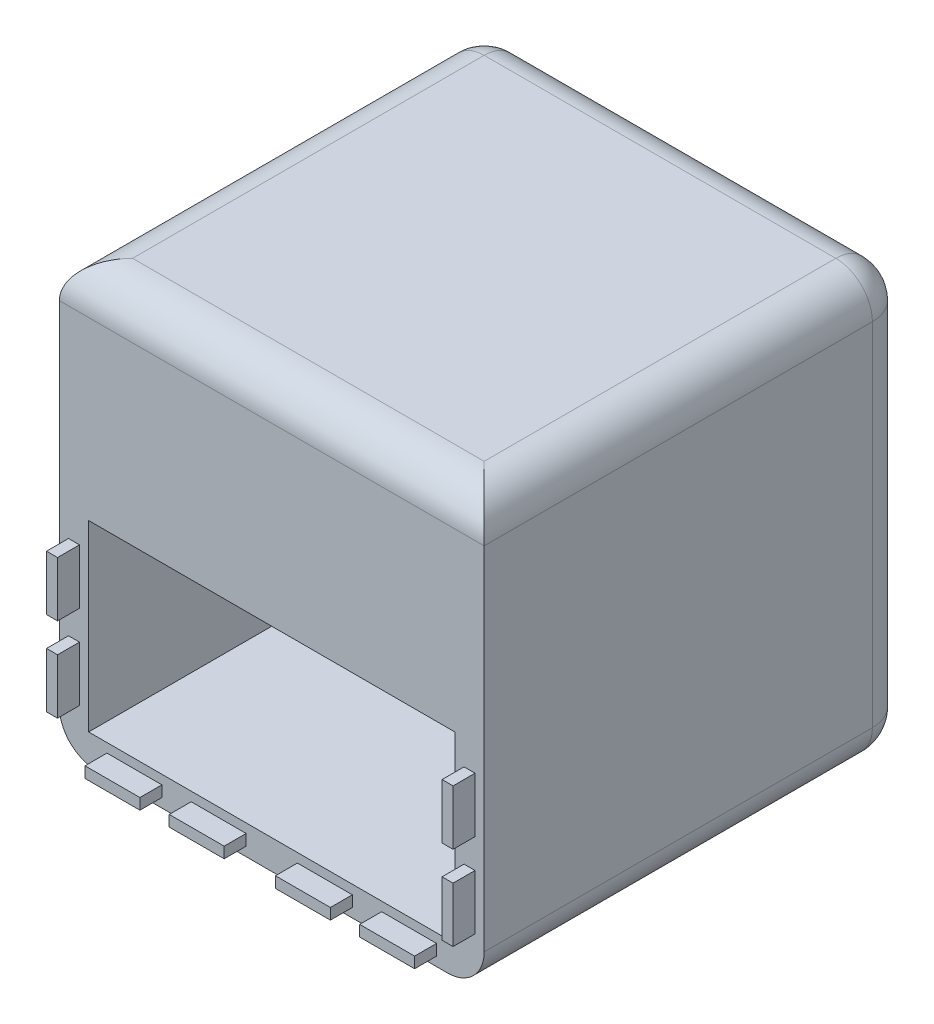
ISO-10303-21;
HEADER;
FILE_DESCRIPTION(('STEP AP214'),'2;1');
FILE_NAME('part.step','',(''),(''),'','','');
FILE_SCHEMA(('AUTOMOTIVE_DESIGN { 1 0 10303 214 1 1 1 1 }'));
ENDSEC;
DATA;
#1=APPLICATION_CONTEXT('core data for automotive mechanical design processes');
#2=APPLICATION_PROTOCOL_DEFINITION('international standard','automotive_design',2000,#1);
#3=PRODUCT_CONTEXT('',#1,'mechanical');
#4=PRODUCT('Part','Part','',(#3));
#5=PRODUCT_RELATED_PRODUCT_CATEGORY('part','',(#4));
#6=PRODUCT_DEFINITION_FORMATION('','',#4);
#7=PRODUCT_DEFINITION_CONTEXT('part definition',#1,'design');
#8=PRODUCT_DEFINITION('design','',#6,#7);
#9=PRODUCT_DEFINITION_SHAPE('','',#8);
#10=(LENGTH_UNIT() NAMED_UNIT(*) SI_UNIT(.MILLI.,.METRE.));
#11=(NAMED_UNIT(*) PLANE_ANGLE_UNIT() SI_UNIT($,.RADIAN.));
#12=(NAMED_UNIT(*) SI_UNIT($,.STERADIAN.) SOLID_ANGLE_UNIT());
#13=UNCERTAINTY_MEASURE_WITH_UNIT(LENGTH_MEASURE(1.E-05),#10,'distance_accuracy_value','');
#14=(GEOMETRIC_REPRESENTATION_CONTEXT(3) GLOBAL_UNCERTAINTY_ASSIGNED_CONTEXT((#13)) GLOBAL_UNIT_ASSIGNED_CONTEXT((#10,
#11,#12)) REPRESENTATION_CONTEXT('',''));
#15=CARTESIAN_POINT('',(0.,0.,0.));
#16=DIRECTION('',(0.,0.,1.));
#17=DIRECTION('',(1.,0.,0.));
#18=AXIS2_PLACEMENT_3D('',#15,#16,#17);
#19=CARTESIAN_POINT('',(0.,0.,116.));
#20=DIRECTION('',(0.,0.,-1.));
#21=DIRECTION('',(-1.,0.,0.));
#22=AXIS2_PLACEMENT_3D('',#19,#20,#21);
#23=PLANE('',#22);
#24=DIRECTION('',(0.,1.,0.));
#25=VECTOR('',#24,1.);
#26=CARTESIAN_POINT('',(113.5,13.,116.));
#27=LINE('',#26,#25);
#28=CARTESIAN_POINT('',(113.5,13.,116.));
#29=VERTEX_POINT('',#28);
#30=CARTESIAN_POINT('',(113.5,28.,116.));
#31=VERTEX_POINT('',#30);
#32=EDGE_CURVE('E439',#29,#31,#27,.T.);
#33=ORIENTED_EDGE('',*,*,#32,.F.);
#34=DIRECTION('',(1.,0.,0.));
#35=VECTOR('',#34,1.);
#36=CARTESIAN_POINT('',(113.5,13.,116.));
#37=LINE('',#36,#35);
#38=CARTESIAN_POINT('',(110.5,13.,116.));
#39=VERTEX_POINT('',#38);
#40=EDGE_CURVE('E426',#39,#29,#37,.T.);
#41=ORIENTED_EDGE('',*,*,#40,.F.);
#42=DIRECTION('',(0.,-1.,0.));
#43=VECTOR('',#42,1.);
#44=CARTESIAN_POINT('',(110.5,13.,116.));
#45=LINE('',#44,#43);
#46=CARTESIAN_POINT('',(110.5,28.,116.));
#47=VERTEX_POINT('',#46);
#48=EDGE_CURVE('E430',#47,#39,#45,.T.);
#49=ORIENTED_EDGE('',*,*,#48,.F.);
#50=DIRECTION('',(-1.,0.,0.));
#51=VECTOR('',#50,1.);
#52=CARTESIAN_POINT('',(113.5,28.,116.));
#53=LINE('',#52,#51);
#54=EDGE_CURVE('E435',#31,#47,#53,.T.);
#55=ORIENTED_EDGE('',*,*,#54,.F.);
#56=EDGE_LOOP('',(#33,#41,#49,#55));
#57=FACE_BOUND('',#56,.T.);
#58=DIRECTION('',(0.,-1.,0.));
#59=VECTOR('',#58,1.);
#60=CARTESIAN_POINT('',(65.,5.5,116.));
#61=LINE('',#60,#59);
#62=CARTESIAN_POINT('',(65.,5.5,116.));
#63=VERTEX_POINT('',#62);
#64=CARTESIAN_POINT('',(65.,2.5,116.));
#65=VERTEX_POINT('',#64);
#66=EDGE_CURVE('E529',#63,#65,#61,.T.);
#67=ORIENTED_EDGE('',*,*,#66,.F.);
#68=DIRECTION('',(-1.,0.,0.));
#69=VECTOR('',#68,1.);
#70=CARTESIAN_POINT('',(65.,5.5,116.));
#71=LINE('',#70,#69);
#72=CARTESIAN_POINT('',(80.,5.5,116.));
#73=VERTEX_POINT('',#72);
#74=EDGE_CURVE('E516',#73,#63,#71,.T.);
#75=ORIENTED_EDGE('',*,*,#74,.F.);
#76=DIRECTION('',(0.,1.,0.));
#77=VECTOR('',#76,1.);
#78=CARTESIAN_POINT('',(80.,5.5,116.));
#79=LINE('',#78,#77);
#80=CARTESIAN_POINT('',(80.,2.5,116.));
#81=VERTEX_POINT('',#80);
#82=EDGE_CURVE('E520',#81,#73,#79,.T.);
#83=ORIENTED_EDGE('',*,*,#82,.F.);
#84=DIRECTION('',(1.,0.,0.));
#85=VECTOR('',#84,1.);
#86=CARTESIAN_POINT('',(65.,2.5,116.));
#87=LINE('',#86,#85);
#88=EDGE_CURVE('E525',#65,#81,#87,.T.);
#89=ORIENTED_EDGE('',*,*,#88,.F.);
#90=EDGE_LOOP('',(#67,#75,#83,#89));
#91=FACE_BOUND('',#90,.T.);
#92=DIRECTION('',(0.,-1.,0.));
#93=VECTOR('',#92,1.);
#94=CARTESIAN_POINT('',(13.,5.5,116.));
#95=LINE('',#94,#93);
#96=CARTESIAN_POINT('',(13.,5.5,116.));
#97=VERTEX_POINT('',#96);
#98=CARTESIAN_POINT('',(13.,2.5,116.));
#99=VERTEX_POINT('',#98);
#100=EDGE_CURVE('E619',#97,#99,#95,.T.);
#101=ORIENTED_EDGE('',*,*,#100,.F.);
#102=DIRECTION('',(-1.,0.,0.));
#103=VECTOR('',#102,1.);
#104=CARTESIAN_POINT('',(13.,5.5,116.));
#105=LINE('',#104,#103);
#106=CARTESIAN_POINT('',(28.,5.5,116.));
#107=VERTEX_POINT('',#106);
#108=EDGE_CURVE('E606',#107,#97,#105,.T.);
#109=ORIENTED_EDGE('',*,*,#108,.F.);
#110=DIRECTION('',(0.,1.,0.));
#111=VECTOR('',#110,1.);
#112=CARTESIAN_POINT('',(28.,5.5,116.));
#113=LINE('',#112,#111);
#114=CARTESIAN_POINT('',(28.,2.5,116.));
#115=VERTEX_POINT('',#114);
#116=EDGE_CURVE('E610',#115,#107,#113,.T.);
#117=ORIENTED_EDGE('',*,*,#116,.F.);
#118=DIRECTION('',(1.,0.,0.));
#119=VECTOR('',#118,1.);
#120=CARTESIAN_POINT('',(13.,2.5,116.));
#121=LINE('',#120,#119);
#122=EDGE_CURVE('E615',#99,#115,#121,.T.);
#123=ORIENTED_EDGE('',*,*,#122,.F.);
#124=EDGE_LOOP('',(#101,#109,#117,#123));
#125=FACE_BOUND('',#124,.T.);
#126=DIRECTION('',(0.,1.,0.));
#127=VECTOR('',#126,1.);
#128=CARTESIAN_POINT('',(5.5,13.,116.));
#129=LINE('',#128,#127);
#130=CARTESIAN_POINT('',(5.5,13.,116.));
#131=VERTEX_POINT('',#130);
#132=CARTESIAN_POINT('',(5.5,28.,116.));
#133=VERTEX_POINT('',#132);
#134=EDGE_CURVE('E668',#131,#133,#129,.T.);
#135=ORIENTED_EDGE('',*,*,#134,.F.);
#136=DIRECTION('',(1.,0.,0.));
#137=VECTOR('',#136,1.);
#138=CARTESIAN_POINT('',(5.5,13.,116.));
#139=LINE('',#138,#137);
#140=CARTESIAN_POINT('',(2.5,13.,116.));
#141=VERTEX_POINT('',#140);
#142=EDGE_CURVE('E685',#141,#131,#139,.T.);
#143=ORIENTED_EDGE('',*,*,#142,.F.);
#144=DIRECTION('',(0.,-1.,0.));
#145=VECTOR('',#144,1.);
#146=CARTESIAN_POINT('',(2.5,13.,116.));
#147=LINE('',#146,#145);
#148=CARTESIAN_POINT('',(2.5,28.,116.));
#149=VERTEX_POINT('',#148);
#150=EDGE_CURVE('E702',#149,#141,#147,.T.);
#151=ORIENTED_EDGE('',*,*,#150,.F.);
#152=DIRECTION('',(-1.,0.,0.));
#153=VECTOR('',#152,1.);
#154=CARTESIAN_POINT('',(5.5,28.,116.));
#155=LINE('',#154,#153);
#156=EDGE_CURVE('E698',#133,#149,#155,.T.);
#157=ORIENTED_EDGE('',*,*,#156,.F.);
#158=EDGE_LOOP('',(#135,#143,#151,#157));
#159=FACE_BOUND('',#158,.T.);
#160=DIRECTION('',(1.,0.,0.));
#161=VECTOR('',#160,1.);
#162=CARTESIAN_POINT('',(8.,8.,116.));
#163=LINE('',#162,#161);
#164=CARTESIAN_POINT('',(8.,8.,116.));
#165=VERTEX_POINT('',#164);
#166=CARTESIAN_POINT('',(108.,8.,116.));
#167=VERTEX_POINT('',#166);
#168=EDGE_CURVE('E734',#165,#167,#163,.T.);
#169=ORIENTED_EDGE('',*,*,#168,.F.);
#170=DIRECTION('',(0.,-1.,0.));
#171=VECTOR('',#170,1.);
#172=CARTESIAN_POINT('',(8.,58.,116.));
#173=LINE('',#172,#171);
#174=CARTESIAN_POINT('',(8.,58.,116.));
#175=VERTEX_POINT('',#174);
#176=EDGE_CURVE('E724',#175,#165,#173,.T.);
#177=ORIENTED_EDGE('',*,*,#176,.F.);
#178=DIRECTION('',(-1.,0.,0.));
#179=VECTOR('',#178,1.);
#180=CARTESIAN_POINT('',(8.,58.,116.));
#181=LINE('',#180,#179);
#182=CARTESIAN_POINT('',(108.,58.,116.));
#183=VERTEX_POINT('',#182);
#184=EDGE_CURVE('E730',#183,#175,#181,.T.);
#185=ORIENTED_EDGE('',*,*,#184,.F.);
#186=DIRECTION('',(0.,1.,0.));
#187=VECTOR('',#186,1.);
#188=CARTESIAN_POINT('',(108.,58.,116.));
#189=LINE('',#188,#187);
#190=EDGE_CURVE('E738',#167,#183,#189,.T.);
#191=ORIENTED_EDGE('',*,*,#190,.F.);
#192=EDGE_LOOP('',(#169,#177,#185,#191));
#193=FACE_BOUND('',#192,.T.);
#194=DIRECTION('',(0.,-1.,0.));
#195=VECTOR('',#194,1.);
#196=CARTESIAN_POINT('',(0.,0.,116.));
#197=LINE('',#196,#195);
#198=CARTESIAN_POINT('',(0.,106.,116.));
#199=VERTEX_POINT('',#198);
#200=CARTESIAN_POINT('',(0.,10.,116.));
#201=VERTEX_POINT('',#200);
#202=EDGE_CURVE('E780',#199,#201,#197,.T.);
#203=ORIENTED_EDGE('',*,*,#202,.T.);
#204=CARTESIAN_POINT('',(10.,10.,116.));
#205=DIRECTION('',(0.,0.,-1.));
#206=DIRECTION('',(-1.,0.,0.));
#207=AXIS2_PLACEMENT_3D('',#204,#205,#206);
#208=CIRCLE('',#207,10.);
#209=CARTESIAN_POINT('',(10.,0.,116.));
#210=VERTEX_POINT('',#209);
#211=EDGE_CURVE('E826',#201,#210,#208,.F.);
#212=ORIENTED_EDGE('',*,*,#211,.T.);
#213=DIRECTION('',(1.,0.,0.));
#214=VECTOR('',#213,1.);
#215=CARTESIAN_POINT('',(0.,0.,116.));
#216=LINE('',#215,#214);
#217=CARTESIAN_POINT('',(106.,0.,116.));
#218=VERTEX_POINT('',#217);
#219=EDGE_CURVE('E793',#210,#218,#216,.T.);
#220=ORIENTED_EDGE('',*,*,#219,.T.);
#221=CARTESIAN_POINT('',(106.,10.,116.));
#222=DIRECTION('',(0.,0.,-1.));
#223=DIRECTION('',(-1.,0.,0.));
#224=AXIS2_PLACEMENT_3D('',#221,#222,#223);
#225=CIRCLE('',#224,10.);
#226=CARTESIAN_POINT('',(116.,10.,116.));
#227=VERTEX_POINT('',#226);
#228=EDGE_CURVE('E823',#218,#227,#225,.F.);
#229=ORIENTED_EDGE('',*,*,#228,.T.);
#230=DIRECTION('',(0.,1.,0.));
#231=VECTOR('',#230,1.);
#232=CARTESIAN_POINT('',(116.,0.,116.));
#233=LINE('',#232,#231);
#234=CARTESIAN_POINT('',(116.,106.,116.));
#235=VERTEX_POINT('',#234);
#236=EDGE_CURVE('E797',#227,#235,#233,.T.);
#237=ORIENTED_EDGE('',*,*,#236,.T.);
#238=DIRECTION('',(-1.,0.,0.));
#239=VECTOR('',#238,1.);
#240=CARTESIAN_POINT('',(0.,106.,116.));
#241=LINE('',#240,#239);
#242=EDGE_CURVE('E820',#235,#199,#241,.T.);
#243=ORIENTED_EDGE('',*,*,#242,.T.);
#244=EDGE_LOOP('',(#203,#212,#220,#229,#237,#243));
#245=FACE_BOUND('',#244,.T.);
#246=DIRECTION('',(0.,1.,0.));
#247=VECTOR('',#246,1.);
#248=CARTESIAN_POINT('',(5.5,36.,116.));
#249=LINE('',#248,#247);
#250=CARTESIAN_POINT('',(5.5,36.,116.));
#251=VERTEX_POINT('',#250);
#252=CARTESIAN_POINT('',(5.5,51.,116.));
#253=VERTEX_POINT('',#252);
#254=EDGE_CURVE('E664',#251,#253,#249,.T.);
#255=ORIENTED_EDGE('',*,*,#254,.F.);
#256=DIRECTION('',(1.,0.,0.));
#257=VECTOR('',#256,1.);
#258=CARTESIAN_POINT('',(5.5,36.,116.));
#259=LINE('',#258,#257);
#260=CARTESIAN_POINT('',(2.5,36.,116.));
#261=VERTEX_POINT('',#260);
#262=EDGE_CURVE('E651',#261,#251,#259,.T.);
#263=ORIENTED_EDGE('',*,*,#262,.F.);
#264=DIRECTION('',(0.,-1.,0.));
#265=VECTOR('',#264,1.);
#266=CARTESIAN_POINT('',(2.5,36.,116.));
#267=LINE('',#266,#265);
#268=CARTESIAN_POINT('',(2.5,51.,116.));
#269=VERTEX_POINT('',#268);
#270=EDGE_CURVE('E655',#269,#261,#267,.T.);
#271=ORIENTED_EDGE('',*,*,#270,.F.);
#272=DIRECTION('',(-1.,0.,0.));
#273=VECTOR('',#272,1.);
#274=CARTESIAN_POINT('',(5.5,51.,116.));
#275=LINE('',#274,#273);
#276=EDGE_CURVE('E660',#253,#269,#275,.T.);
#277=ORIENTED_EDGE('',*,*,#276,.F.);
#278=EDGE_LOOP('',(#255,#263,#271,#277));
#279=FACE_BOUND('',#278,.T.);
#280=DIRECTION('',(0.,-1.,0.));
#281=VECTOR('',#280,1.);
#282=CARTESIAN_POINT('',(36.,5.5,116.));
#283=LINE('',#282,#281);
#284=CARTESIAN_POINT('',(36.,5.5,116.));
#285=VERTEX_POINT('',#284);
#286=CARTESIAN_POINT('',(36.,2.5,116.));
#287=VERTEX_POINT('',#286);
#288=EDGE_CURVE('E574',#285,#287,#283,.T.);
#289=ORIENTED_EDGE('',*,*,#288,.F.);
#290=DIRECTION('',(-1.,0.,0.));
#291=VECTOR('',#290,1.);
#292=CARTESIAN_POINT('',(36.,5.5,116.));
#293=LINE('',#292,#291);
#294=CARTESIAN_POINT('',(51.,5.5,116.));
#295=VERTEX_POINT('',#294);
#296=EDGE_CURVE('E561',#295,#285,#293,.T.);
#297=ORIENTED_EDGE('',*,*,#296,.F.);
#298=DIRECTION('',(0.,1.,0.));
#299=VECTOR('',#298,1.);
#300=CARTESIAN_POINT('',(51.,5.5,116.));
#301=LINE('',#300,#299);
#302=CARTESIAN_POINT('',(51.,2.5,116.));
#303=VERTEX_POINT('',#302);
#304=EDGE_CURVE('E565',#303,#295,#301,.T.);
#305=ORIENTED_EDGE('',*,*,#304,.F.);
#306=DIRECTION('',(1.,0.,0.));
#307=VECTOR('',#306,1.);
#308=CARTESIAN_POINT('',(36.,2.5,116.));
#309=LINE('',#308,#307);
#310=EDGE_CURVE('E570',#287,#303,#309,.T.);
#311=ORIENTED_EDGE('',*,*,#310,.F.);
#312=EDGE_LOOP('',(#289,#297,#305,#311));
#313=FACE_BOUND('',#312,.T.);
#314=DIRECTION('',(0.,-1.,0.));
#315=VECTOR('',#314,1.);
#316=CARTESIAN_POINT('',(88.,5.49999999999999,116.));
#317=LINE('',#316,#315);
#318=CARTESIAN_POINT('',(88.,5.49999999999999,116.));
#319=VERTEX_POINT('',#318);
#320=CARTESIAN_POINT('',(88.,2.5,116.));
#321=VERTEX_POINT('',#320);
#322=EDGE_CURVE('E484',#319,#321,#317,.T.);
#323=ORIENTED_EDGE('',*,*,#322,.F.);
#324=DIRECTION('',(-1.,0.,0.));
#325=VECTOR('',#324,1.);
#326=CARTESIAN_POINT('',(88.,5.49999999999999,116.));
#327=LINE('',#326,#325);
#328=CARTESIAN_POINT('',(103.,5.5,116.));
#329=VERTEX_POINT('',#328);
#330=EDGE_CURVE('E471',#329,#319,#327,.T.);
#331=ORIENTED_EDGE('',*,*,#330,.F.);
#332=DIRECTION('',(0.,1.,0.));
#333=VECTOR('',#332,1.);
#334=CARTESIAN_POINT('',(103.,5.5,116.));
#335=LINE('',#334,#333);
#336=CARTESIAN_POINT('',(103.,2.5,116.));
#337=VERTEX_POINT('',#336);
#338=EDGE_CURVE('E475',#337,#329,#335,.T.);
#339=ORIENTED_EDGE('',*,*,#338,.F.);
#340=DIRECTION('',(1.,0.,0.));
#341=VECTOR('',#340,1.);
#342=CARTESIAN_POINT('',(88.,2.5,116.));
#343=LINE('',#342,#341);
#344=EDGE_CURVE('E480',#321,#337,#343,.T.);
#345=ORIENTED_EDGE('',*,*,#344,.F.);
#346=EDGE_LOOP('',(#323,#331,#339,#345));
#347=FACE_BOUND('',#346,.T.);
#348=DIRECTION('',(0.,1.,0.));
#349=VECTOR('',#348,1.);
#350=CARTESIAN_POINT('',(113.5,36.,116.));
#351=LINE('',#350,#349);
#352=CARTESIAN_POINT('',(113.5,36.,116.));
#353=VERTEX_POINT('',#352);
#354=CARTESIAN_POINT('',(113.5,51.,116.));
#355=VERTEX_POINT('',#354);
#356=EDGE_CURVE('E360',#353,#355,#351,.T.);
#357=ORIENTED_EDGE('',*,*,#356,.F.);
#358=DIRECTION('',(1.,0.,0.));
#359=VECTOR('',#358,1.);
#360=CARTESIAN_POINT('',(113.5,36.,116.));
#361=LINE('',#360,#359);
#362=CARTESIAN_POINT('',(110.5,36.,116.));
#363=VERTEX_POINT('',#362);
#364=EDGE_CURVE('E362',#363,#353,#361,.T.);
#365=ORIENTED_EDGE('',*,*,#364,.F.);
#366=DIRECTION('',(0.,-1.,0.));
#367=VECTOR('',#366,1.);
#368=CARTESIAN_POINT('',(110.5,36.,116.));
#369=LINE('',#368,#367);
#370=CARTESIAN_POINT('',(110.5,51.,116.));
#371=VERTEX_POINT('',#370);
#372=EDGE_CURVE('E383',#371,#363,#369,.T.);
#373=ORIENTED_EDGE('',*,*,#372,.F.);
#374=DIRECTION('',(-1.,0.,0.));
#375=VECTOR('',#374,1.);
#376=CARTESIAN_POINT('',(113.5,51.,116.));
#377=LINE('',#376,#375);
#378=EDGE_CURVE('E365',#355,#371,#377,.T.);
#379=ORIENTED_EDGE('',*,*,#378,.F.);
#380=EDGE_LOOP('',(#357,#365,#373,#379));
#381=FACE_BOUND('',#380,.T.);
#382=ADVANCED_FACE('F51',(#57,#91,#125,#159,#193,#245,#279,#313,#347,#381),#23,.F.);
#383=CARTESIAN_POINT('',(0.,108.,0.));
#384=DIRECTION('',(0.,1.,0.));
#385=DIRECTION('',(0.,0.,1.));
#386=AXIS2_PLACEMENT_3D('',#383,#384,#385);
#387=PLANE('',#386);
#388=DIRECTION('',(0.,0.,1.));
#389=VECTOR('',#388,1.);
#390=CARTESIAN_POINT('',(8.,108.,8.));
#391=LINE('',#390,#389);
#392=CARTESIAN_POINT('',(8.,108.,8.));
#393=VERTEX_POINT('',#392);
#394=CARTESIAN_POINT('',(8.00000000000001,108.,108.));
#395=VERTEX_POINT('',#394);
#396=EDGE_CURVE('E748',#393,#395,#391,.T.);
#397=ORIENTED_EDGE('',*,*,#396,.F.);
#398=DIRECTION('',(-1.,0.,0.));
#399=VECTOR('',#398,1.);
#400=CARTESIAN_POINT('',(8.,108.,8.));
#401=LINE('',#400,#399);
#402=CARTESIAN_POINT('',(108.,108.,8.));
#403=VERTEX_POINT('',#402);
#404=EDGE_CURVE('E761',#403,#393,#401,.T.);
#405=ORIENTED_EDGE('',*,*,#404,.F.);
#406=DIRECTION('',(0.,0.,-1.));
#407=VECTOR('',#406,1.);
#408=CARTESIAN_POINT('',(108.,108.,8.));
#409=LINE('',#408,#407);
#410=CARTESIAN_POINT('',(108.,108.,108.));
#411=VERTEX_POINT('',#410);
#412=EDGE_CURVE('E758',#411,#403,#409,.T.);
#413=ORIENTED_EDGE('',*,*,#412,.F.);
#414=DIRECTION('',(1.,0.,0.));
#415=VECTOR('',#414,1.);
#416=CARTESIAN_POINT('',(8.00000000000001,108.,108.));
#417=LINE('',#416,#415);
#418=EDGE_CURVE('E754',#395,#411,#417,.T.);
#419=ORIENTED_EDGE('',*,*,#418,.F.);
#420=EDGE_LOOP('',(#397,#405,#413,#419));
#421=FACE_BOUND('',#420,.T.);
#422=ADVANCED_FACE('F936',(#421),#387,.F.);
#423=CARTESIAN_POINT('',(0.,8.00000000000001,0.));
#424=DIRECTION('',(0.,1.,0.));
#425=DIRECTION('',(0.,0.,1.));
#426=AXIS2_PLACEMENT_3D('',#423,#424,#425);
#427=PLANE('',#426);
#428=DIRECTION('',(0.,0.,1.));
#429=VECTOR('',#428,1.);
#430=CARTESIAN_POINT('',(8.,8.00000000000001,8.));
#431=LINE('',#430,#429);
#432=CARTESIAN_POINT('',(8.,8.00000000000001,8.));
#433=VERTEX_POINT('',#432);
#434=EDGE_CURVE('E764',#433,#165,#431,.T.);
#435=ORIENTED_EDGE('',*,*,#434,.T.);
#436=ORIENTED_EDGE('',*,*,#168,.T.);
#437=DIRECTION('',(0.,0.,-1.));
#438=VECTOR('',#437,1.);
#439=CARTESIAN_POINT('',(108.,8.00000000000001,8.));
#440=LINE('',#439,#438);
#441=CARTESIAN_POINT('',(108.,8.00000000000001,8.));
#442=VERTEX_POINT('',#441);
#443=EDGE_CURVE('E767',#167,#442,#440,.T.);
#444=ORIENTED_EDGE('',*,*,#443,.T.);
#445=DIRECTION('',(-1.,0.,0.));
#446=VECTOR('',#445,1.);
#447=CARTESIAN_POINT('',(8.,8.00000000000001,8.));
#448=LINE('',#447,#446);
#449=EDGE_CURVE('E771',#442,#433,#448,.T.);
#450=ORIENTED_EDGE('',*,*,#449,.T.);
#451=EDGE_LOOP('',(#435,#436,#444,#450));
#452=FACE_BOUND('',#451,.T.);
#453=ADVANCED_FACE('F943',(#452),#427,.T.);
#454=CARTESIAN_POINT('',(8.00000000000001,8.00000000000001,108.));
#455=DIRECTION('',(0.,0.,1.));
#456=DIRECTION('',(1.,0.,0.));
#457=AXIS2_PLACEMENT_3D('',#454,#455,#456);
#458=PLANE('',#457);
#459=DIRECTION('',(0.,1.,0.));
#460=VECTOR('',#459,1.);
#461=CARTESIAN_POINT('',(108.,8.00000000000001,108.));
#462=LINE('',#461,#460);
#463=CARTESIAN_POINT('',(108.,58.,108.));
#464=VERTEX_POINT('',#463);
#465=EDGE_CURVE('E785',#464,#411,#462,.T.);
#466=ORIENTED_EDGE('',*,*,#465,.F.);
#467=DIRECTION('',(-1.,0.,0.));
#468=VECTOR('',#467,1.);
#469=CARTESIAN_POINT('',(8.,58.,108.));
#470=LINE('',#469,#468);
#471=CARTESIAN_POINT('',(8.00000000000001,58.,108.));
#472=VERTEX_POINT('',#471);
#473=EDGE_CURVE('E725',#464,#472,#470,.T.);
#474=ORIENTED_EDGE('',*,*,#473,.T.);
#475=DIRECTION('',(0.,1.,0.));
#476=VECTOR('',#475,1.);
#477=CARTESIAN_POINT('',(8.00000000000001,8.00000000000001,108.));
#478=LINE('',#477,#476);
#479=EDGE_CURVE('E775',#472,#395,#478,.T.);
#480=ORIENTED_EDGE('',*,*,#479,.T.);
#481=ORIENTED_EDGE('',*,*,#418,.T.);
#482=EDGE_LOOP('',(#466,#474,#480,#481));
#483=FACE_BOUND('',#482,.T.);
#484=ADVANCED_FACE('F1182',(#483),#458,.F.);
#485=CARTESIAN_POINT('',(108.,8.00000000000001,8.));
#486=DIRECTION('',(1.,0.,0.));
#487=DIRECTION('',(0.,0.,-1.));
#488=AXIS2_PLACEMENT_3D('',#485,#486,#487);
#489=PLANE('',#488);
#490=ORIENTED_EDGE('',*,*,#412,.T.);
#491=DIRECTION('',(0.,1.,0.));
#492=VECTOR('',#491,1.);
#493=CARTESIAN_POINT('',(108.,8.00000000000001,8.));
#494=LINE('',#493,#492);
#495=EDGE_CURVE('E781',#442,#403,#494,.T.);
#496=ORIENTED_EDGE('',*,*,#495,.F.);
#497=ORIENTED_EDGE('',*,*,#443,.F.);
#498=ORIENTED_EDGE('',*,*,#190,.T.);
#499=DIRECTION('',(0.,0.,1.));
#500=VECTOR('',#499,1.);
#501=CARTESIAN_POINT('',(108.,58.,108.));
#502=LINE('',#501,#500);
#503=EDGE_CURVE('E729',#464,#183,#502,.T.);
#504=ORIENTED_EDGE('',*,*,#503,.F.);
#505=ORIENTED_EDGE('',*,*,#465,.T.);
#506=EDGE_LOOP('',(#490,#496,#497,#498,#504,#505));
#507=FACE_BOUND('',#506,.T.);
#508=ADVANCED_FACE('F1187',(#507),#489,.F.);
#509=CARTESIAN_POINT('',(8.,8.00000000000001,8.));
#510=DIRECTION('',(0.,0.,-1.));
#511=DIRECTION('',(-1.,0.,0.));
#512=AXIS2_PLACEMENT_3D('',#509,#510,#511);
#513=PLANE('',#512);
#514=ORIENTED_EDGE('',*,*,#404,.T.);
#515=DIRECTION('',(0.,1.,0.));
#516=VECTOR('',#515,1.);
#517=CARTESIAN_POINT('',(8.,8.00000000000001,8.));
#518=LINE('',#517,#516);
#519=EDGE_CURVE('E776',#433,#393,#518,.T.);
#520=ORIENTED_EDGE('',*,*,#519,.F.);
#521=ORIENTED_EDGE('',*,*,#449,.F.);
#522=ORIENTED_EDGE('',*,*,#495,.T.);
#523=EDGE_LOOP('',(#514,#520,#521,#522));
#524=FACE_BOUND('',#523,.T.);
#525=ADVANCED_FACE('F1184',(#524),#513,.F.);
#526=CARTESIAN_POINT('',(8.,8.00000000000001,8.));
#527=DIRECTION('',(-1.,0.,0.));
#528=DIRECTION('',(0.,0.,1.));
#529=AXIS2_PLACEMENT_3D('',#526,#527,#528);
#530=PLANE('',#529);
#531=ORIENTED_EDGE('',*,*,#396,.T.);
#532=ORIENTED_EDGE('',*,*,#479,.F.);
#533=DIRECTION('',(0.,0.,1.));
#534=VECTOR('',#533,1.);
#535=CARTESIAN_POINT('',(8.,58.,108.));
#536=LINE('',#535,#534);
#537=EDGE_CURVE('E745',#472,#175,#536,.T.);
#538=ORIENTED_EDGE('',*,*,#537,.T.);
#539=ORIENTED_EDGE('',*,*,#176,.T.);
#540=ORIENTED_EDGE('',*,*,#434,.F.);
#541=ORIENTED_EDGE('',*,*,#519,.T.);
#542=EDGE_LOOP('',(#531,#532,#538,#539,#540,#541));
#543=FACE_BOUND('',#542,.T.);
#544=ADVANCED_FACE('F949',(#543),#530,.F.);
#545=CARTESIAN_POINT('',(8.,58.,108.));
#546=DIRECTION('',(0.,1.,0.));
#547=DIRECTION('',(0.,0.,1.));
#548=AXIS2_PLACEMENT_3D('',#545,#546,#547);
#549=PLANE('',#548);
#550=ORIENTED_EDGE('',*,*,#184,.T.);
#551=ORIENTED_EDGE('',*,*,#537,.F.);
#552=ORIENTED_EDGE('',*,*,#473,.F.);
#553=ORIENTED_EDGE('',*,*,#503,.T.);
#554=EDGE_LOOP('',(#550,#551,#552,#553));
#555=FACE_BOUND('',#554,.T.);
#556=ADVANCED_FACE('F969',(#555),#549,.F.);
#557=CARTESIAN_POINT('',(0.,0.,116.));
#558=DIRECTION('',(1.,0.,0.));
#559=DIRECTION('',(0.,0.,-1.));
#560=AXIS2_PLACEMENT_3D('',#557,#558,#559);
#561=PLANE('',#560);
#562=DIRECTION('',(0.,-1.,0.));
#563=VECTOR('',#562,1.);
#564=CARTESIAN_POINT('',(0.,0.,9.99999999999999));
#565=LINE('',#564,#563);
#566=CARTESIAN_POINT('',(0.,106.,9.99999999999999));
#567=VERTEX_POINT('',#566);
#568=CARTESIAN_POINT('',(0.,10.,9.99999999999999));
#569=VERTEX_POINT('',#568);
#570=EDGE_CURVE('E814',#567,#569,#565,.T.);
#571=ORIENTED_EDGE('',*,*,#570,.T.);
#572=DIRECTION('',(0.,0.,-1.));
#573=VECTOR('',#572,1.);
#574=CARTESIAN_POINT('',(0.,10.,116.));
#575=LINE('',#574,#573);
#576=EDGE_CURVE('E817',#569,#201,#575,.F.);
#577=ORIENTED_EDGE('',*,*,#576,.T.);
#578=ORIENTED_EDGE('',*,*,#202,.F.);
#579=DIRECTION('',(0.,0.,-1.));
#580=VECTOR('',#579,1.);
#581=CARTESIAN_POINT('',(0.,106.,116.));
#582=LINE('',#581,#580);
#583=EDGE_CURVE('E811',#199,#567,#582,.T.);
#584=ORIENTED_EDGE('',*,*,#583,.T.);
#585=EDGE_LOOP('',(#571,#577,#578,#584));
#586=FACE_BOUND('',#585,.T.);
#587=ADVANCED_FACE('F966',(#586),#561,.F.);
#588=CARTESIAN_POINT('',(0.,0.,116.));
#589=DIRECTION('',(0.,1.,0.));
#590=DIRECTION('',(0.,0.,1.));
#591=AXIS2_PLACEMENT_3D('',#588,#589,#590);
#592=PLANE('',#591);
#593=ORIENTED_EDGE('',*,*,#219,.F.);
#594=DIRECTION('',(0.,0.,-1.));
#595=VECTOR('',#594,1.);
#596=CARTESIAN_POINT('',(10.,0.,116.));
#597=LINE('',#596,#595);
#598=CARTESIAN_POINT('',(10.,0.,9.99999999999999));
#599=VERTEX_POINT('',#598);
#600=EDGE_CURVE('E807',#210,#599,#597,.T.);
#601=ORIENTED_EDGE('',*,*,#600,.T.);
#602=DIRECTION('',(1.,0.,0.));
#603=VECTOR('',#602,1.);
#604=CARTESIAN_POINT('',(116.,0.,9.99999999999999));
#605=LINE('',#604,#603);
#606=CARTESIAN_POINT('',(106.,0.,9.99999999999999));
#607=VERTEX_POINT('',#606);
#608=EDGE_CURVE('E801',#599,#607,#605,.T.);
#609=ORIENTED_EDGE('',*,*,#608,.T.);
#610=DIRECTION('',(0.,0.,-1.));
#611=VECTOR('',#610,1.);
#612=CARTESIAN_POINT('',(106.,0.,116.));
#613=LINE('',#612,#611);
#614=EDGE_CURVE('E804',#607,#218,#613,.F.);
#615=ORIENTED_EDGE('',*,*,#614,.T.);
#616=EDGE_LOOP('',(#593,#601,#609,#615));
#617=FACE_BOUND('',#616,.T.);
#618=ADVANCED_FACE('F962',(#617),#592,.F.);
#619=CARTESIAN_POINT('',(116.,0.,116.));
#620=DIRECTION('',(-1.,0.,0.));
#621=DIRECTION('',(0.,0.,1.));
#622=AXIS2_PLACEMENT_3D('',#619,#620,#621);
#623=PLANE('',#622);
#624=ORIENTED_EDGE('',*,*,#236,.F.);
#625=DIRECTION('',(0.,0.,-1.));
#626=VECTOR('',#625,1.);
#627=CARTESIAN_POINT('',(116.,10.,116.));
#628=LINE('',#627,#626);
#629=CARTESIAN_POINT('',(116.,10.,9.99999999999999));
#630=VERTEX_POINT('',#629);
#631=EDGE_CURVE('E835',#227,#630,#628,.T.);
#632=ORIENTED_EDGE('',*,*,#631,.T.);
#633=DIRECTION('',(0.,1.,0.));
#634=VECTOR('',#633,1.);
#635=CARTESIAN_POINT('',(116.,116.,9.99999999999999));
#636=LINE('',#635,#634);
#637=CARTESIAN_POINT('',(116.,106.,9.99999999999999));
#638=VERTEX_POINT('',#637);
#639=EDGE_CURVE('E832',#630,#638,#636,.T.);
#640=ORIENTED_EDGE('',*,*,#639,.T.);
#641=DIRECTION('',(0.,0.,-1.));
#642=VECTOR('',#641,1.);
#643=CARTESIAN_POINT('',(116.,106.,116.));
#644=LINE('',#643,#642);
#645=EDGE_CURVE('E829',#638,#235,#644,.F.);
#646=ORIENTED_EDGE('',*,*,#645,.T.);
#647=EDGE_LOOP('',(#624,#632,#640,#646));
#648=FACE_BOUND('',#647,.T.);
#649=ADVANCED_FACE('F959',(#648),#623,.F.);
#650=CARTESIAN_POINT('',(0.,116.,116.));
#651=DIRECTION('',(0.,-1.,0.));
#652=DIRECTION('',(0.,0.,-1.));
#653=AXIS2_PLACEMENT_3D('',#650,#651,#652);
#654=PLANE('',#653);
#655=DIRECTION('',(0.,0.,-1.));
#656=VECTOR('',#655,1.);
#657=CARTESIAN_POINT('',(106.,116.,116.));
#658=LINE('',#657,#656);
#659=CARTESIAN_POINT('',(106.,116.,106.));
#660=VERTEX_POINT('',#659);
#661=CARTESIAN_POINT('',(106.,116.,9.99999999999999));
#662=VERTEX_POINT('',#661);
#663=EDGE_CURVE('E76',#660,#662,#658,.T.);
#664=ORIENTED_EDGE('',*,*,#663,.T.);
#665=DIRECTION('',(-1.,0.,0.));
#666=VECTOR('',#665,1.);
#667=CARTESIAN_POINT('',(0.,116.,9.99999999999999));
#668=LINE('',#667,#666);
#669=CARTESIAN_POINT('',(10.,116.,9.99999999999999));
#670=VERTEX_POINT('',#669);
#671=EDGE_CURVE('E11',#662,#670,#668,.T.);
#672=ORIENTED_EDGE('',*,*,#671,.T.);
#673=DIRECTION('',(0.,0.,-1.));
#674=VECTOR('',#673,1.);
#675=CARTESIAN_POINT('',(10.,116.,116.));
#676=LINE('',#675,#674);
#677=CARTESIAN_POINT('',(10.,116.,106.));
#678=VERTEX_POINT('',#677);
#679=EDGE_CURVE('E61',#670,#678,#676,.F.);
#680=ORIENTED_EDGE('',*,*,#679,.T.);
#681=DIRECTION('',(-1.,0.,0.));
#682=VECTOR('',#681,1.);
#683=CARTESIAN_POINT('',(0.,116.,106.));
#684=LINE('',#683,#682);
#685=EDGE_CURVE('E851',#678,#660,#684,.F.);
#686=ORIENTED_EDGE('',*,*,#685,.T.);
#687=EDGE_LOOP('',(#664,#672,#680,#686));
#688=FACE_BOUND('',#687,.T.);
#689=ADVANCED_FACE('F955',(#688),#654,.F.);
#690=CARTESIAN_POINT('',(0.,0.,0.));
#691=DIRECTION('',(0.,0.,-1.));
#692=DIRECTION('',(-1.,0.,0.));
#693=AXIS2_PLACEMENT_3D('',#690,#691,#692);
#694=PLANE('',#693);
#695=DIRECTION('',(0.,1.,0.));
#696=VECTOR('',#695,1.);
#697=CARTESIAN_POINT('',(106.,0.,0.));
#698=LINE('',#697,#696);
#699=CARTESIAN_POINT('',(106.,106.,0.));
#700=VERTEX_POINT('',#699);
#701=CARTESIAN_POINT('',(106.,10.,0.));
#702=VERTEX_POINT('',#701);
#703=EDGE_CURVE('E844',#700,#702,#698,.F.);
#704=ORIENTED_EDGE('',*,*,#703,.T.);
#705=DIRECTION('',(1.,0.,0.));
#706=VECTOR('',#705,1.);
#707=CARTESIAN_POINT('',(0.,10.,0.));
#708=LINE('',#707,#706);
#709=CARTESIAN_POINT('',(10.,10.,0.));
#710=VERTEX_POINT('',#709);
#711=EDGE_CURVE('E847',#702,#710,#708,.F.);
#712=ORIENTED_EDGE('',*,*,#711,.T.);
#713=DIRECTION('',(0.,-1.,0.));
#714=VECTOR('',#713,1.);
#715=CARTESIAN_POINT('',(10.,116.,0.));
#716=LINE('',#715,#714);
#717=CARTESIAN_POINT('',(10.,106.,0.));
#718=VERTEX_POINT('',#717);
#719=EDGE_CURVE('E841',#710,#718,#716,.F.);
#720=ORIENTED_EDGE('',*,*,#719,.T.);
#721=DIRECTION('',(-1.,0.,0.));
#722=VECTOR('',#721,1.);
#723=CARTESIAN_POINT('',(116.,106.,0.));
#724=LINE('',#723,#722);
#725=EDGE_CURVE('E838',#718,#700,#724,.F.);
#726=ORIENTED_EDGE('',*,*,#725,.T.);
#727=EDGE_LOOP('',(#704,#712,#720,#726));
#728=FACE_BOUND('',#727,.T.);
#729=ADVANCED_FACE('F951',(#728),#694,.T.);
#730=CARTESIAN_POINT('',(5.5,13.,122.));
#731=DIRECTION('',(-1.,0.,0.));
#732=DIRECTION('',(0.,0.,1.));
#733=AXIS2_PLACEMENT_3D('',#730,#731,#732);
#734=PLANE('',#733);
#735=ORIENTED_EDGE('',*,*,#134,.T.);
#736=DIRECTION('',(0.,0.,-1.));
#737=VECTOR('',#736,1.);
#738=CARTESIAN_POINT('',(5.5,28.,122.));
#739=LINE('',#738,#737);
#740=CARTESIAN_POINT('',(5.5,28.,122.));
#741=VERTEX_POINT('',#740);
#742=EDGE_CURVE('E720',#741,#133,#739,.T.);
#743=ORIENTED_EDGE('',*,*,#742,.F.);
#744=DIRECTION('',(0.,1.,0.));
#745=VECTOR('',#744,1.);
#746=CARTESIAN_POINT('',(5.5,13.,122.));
#747=LINE('',#746,#745);
#748=CARTESIAN_POINT('',(5.5,13.,122.));
#749=VERTEX_POINT('',#748);
#750=EDGE_CURVE('E680',#749,#741,#747,.T.);
#751=ORIENTED_EDGE('',*,*,#750,.F.);
#752=DIRECTION('',(0.,0.,-1.));
#753=VECTOR('',#752,1.);
#754=CARTESIAN_POINT('',(5.5,13.,122.));
#755=LINE('',#754,#753);
#756=EDGE_CURVE('E694',#749,#131,#755,.T.);
#757=ORIENTED_EDGE('',*,*,#756,.T.);
#758=EDGE_LOOP('',(#735,#743,#751,#757));
#759=FACE_BOUND('',#758,.T.);
#760=ADVANCED_FACE('F954',(#759),#734,.F.);
#761=CARTESIAN_POINT('',(5.5,28.,122.));
#762=DIRECTION('',(0.,-1.,0.));
#763=DIRECTION('',(0.,0.,-1.));
#764=AXIS2_PLACEMENT_3D('',#761,#762,#763);
#765=PLANE('',#764);
#766=ORIENTED_EDGE('',*,*,#156,.T.);
#767=DIRECTION('',(0.,0.,-1.));
#768=VECTOR('',#767,1.);
#769=CARTESIAN_POINT('',(2.5,28.,122.));
#770=LINE('',#769,#768);
#771=CARTESIAN_POINT('',(2.5,28.,122.));
#772=VERTEX_POINT('',#771);
#773=EDGE_CURVE('E716',#772,#149,#770,.T.);
#774=ORIENTED_EDGE('',*,*,#773,.F.);
#775=DIRECTION('',(-1.,0.,0.));
#776=VECTOR('',#775,1.);
#777=CARTESIAN_POINT('',(5.5,28.,122.));
#778=LINE('',#777,#776);
#779=EDGE_CURVE('E684',#741,#772,#778,.T.);
#780=ORIENTED_EDGE('',*,*,#779,.F.);
#781=ORIENTED_EDGE('',*,*,#742,.T.);
#782=EDGE_LOOP('',(#766,#774,#780,#781));
#783=FACE_BOUND('',#782,.T.);
#784=ADVANCED_FACE('F1169',(#783),#765,.F.);
#785=CARTESIAN_POINT('',(2.5,13.,122.));
#786=DIRECTION('',(1.,0.,0.));
#787=DIRECTION('',(0.,1.,0.));
#788=AXIS2_PLACEMENT_3D('',#785,#786,#787);
#789=PLANE('',#788);
#790=ORIENTED_EDGE('',*,*,#150,.T.);
#791=DIRECTION('',(0.,0.,-1.));
#792=VECTOR('',#791,1.);
#793=CARTESIAN_POINT('',(2.5,13.,122.));
#794=LINE('',#793,#792);
#795=CARTESIAN_POINT('',(2.5,13.,122.));
#796=VERTEX_POINT('',#795);
#797=EDGE_CURVE('E712',#796,#141,#794,.T.);
#798=ORIENTED_EDGE('',*,*,#797,.F.);
#799=DIRECTION('',(0.,-1.,0.));
#800=VECTOR('',#799,1.);
#801=CARTESIAN_POINT('',(2.5,13.,122.));
#802=LINE('',#801,#800);
#803=EDGE_CURVE('E688',#772,#796,#802,.T.);
#804=ORIENTED_EDGE('',*,*,#803,.F.);
#805=ORIENTED_EDGE('',*,*,#773,.T.);
#806=EDGE_LOOP('',(#790,#798,#804,#805));
#807=FACE_BOUND('',#806,.T.);
#808=ADVANCED_FACE('F1165',(#807),#789,.F.);
#809=CARTESIAN_POINT('',(5.5,13.,122.));
#810=DIRECTION('',(0.,1.,0.));
#811=DIRECTION('',(-1.,0.,0.));
#812=AXIS2_PLACEMENT_3D('',#809,#810,#811);
#813=PLANE('',#812);
#814=ORIENTED_EDGE('',*,*,#142,.T.);
#815=ORIENTED_EDGE('',*,*,#756,.F.);
#816=DIRECTION('',(1.,0.,0.));
#817=VECTOR('',#816,1.);
#818=CARTESIAN_POINT('',(5.5,13.,122.));
#819=LINE('',#818,#817);
#820=EDGE_CURVE('E691',#796,#749,#819,.T.);
#821=ORIENTED_EDGE('',*,*,#820,.F.);
#822=ORIENTED_EDGE('',*,*,#797,.T.);
#823=EDGE_LOOP('',(#814,#815,#821,#822));
#824=FACE_BOUND('',#823,.T.);
#825=ADVANCED_FACE('F1161',(#824),#813,.F.);
#826=CARTESIAN_POINT('',(0.,0.,122.));
#827=DIRECTION('',(0.,0.,1.));
#828=DIRECTION('',(1.,0.,0.));
#829=AXIS2_PLACEMENT_3D('',#826,#827,#828);
#830=PLANE('',#829);
#831=ORIENTED_EDGE('',*,*,#750,.T.);
#832=ORIENTED_EDGE('',*,*,#779,.T.);
#833=ORIENTED_EDGE('',*,*,#803,.T.);
#834=ORIENTED_EDGE('',*,*,#820,.T.);
#835=EDGE_LOOP('',(#831,#832,#833,#834));
#836=FACE_BOUND('',#835,.T.);
#837=ADVANCED_FACE('F1143',(#836),#830,.T.);
#838=CARTESIAN_POINT('',(5.5,36.,122.));
#839=DIRECTION('',(-1.,0.,0.));
#840=DIRECTION('',(0.,0.,1.));
#841=AXIS2_PLACEMENT_3D('',#838,#839,#840);
#842=PLANE('',#841);
#843=ORIENTED_EDGE('',*,*,#254,.T.);
#844=DIRECTION('',(0.,0.,-1.));
#845=VECTOR('',#844,1.);
#846=CARTESIAN_POINT('',(5.5,51.,122.));
#847=LINE('',#846,#845);
#848=CARTESIAN_POINT('',(5.5,51.,122.));
#849=VERTEX_POINT('',#848);
#850=EDGE_CURVE('E623',#849,#253,#847,.T.);
#851=ORIENTED_EDGE('',*,*,#850,.F.);
#852=DIRECTION('',(0.,1.,0.));
#853=VECTOR('',#852,1.);
#854=CARTESIAN_POINT('',(5.5,36.,122.));
#855=LINE('',#854,#853);
#856=CARTESIAN_POINT('',(5.5,36.,122.));
#857=VERTEX_POINT('',#856);
#858=EDGE_CURVE('E656',#857,#849,#855,.T.);
#859=ORIENTED_EDGE('',*,*,#858,.F.);
#860=DIRECTION('',(0.,0.,-1.));
#861=VECTOR('',#860,1.);
#862=CARTESIAN_POINT('',(5.5,36.,122.));
#863=LINE('',#862,#861);
#864=EDGE_CURVE('E646',#857,#251,#863,.T.);
#865=ORIENTED_EDGE('',*,*,#864,.T.);
#866=EDGE_LOOP('',(#843,#851,#859,#865));
#867=FACE_BOUND('',#866,.T.);
#868=ADVANCED_FACE('F1139',(#867),#842,.F.);
#869=CARTESIAN_POINT('',(5.5,51.,122.));
#870=DIRECTION('',(0.,-1.,0.));
#871=DIRECTION('',(0.,0.,-1.));
#872=AXIS2_PLACEMENT_3D('',#869,#870,#871);
#873=PLANE('',#872);
#874=ORIENTED_EDGE('',*,*,#276,.T.);
#875=DIRECTION('',(0.,0.,-1.));
#876=VECTOR('',#875,1.);
#877=CARTESIAN_POINT('',(2.5,51.,122.));
#878=LINE('',#877,#876);
#879=CARTESIAN_POINT('',(2.5,51.,122.));
#880=VERTEX_POINT('',#879);
#881=EDGE_CURVE('E638',#880,#269,#878,.T.);
#882=ORIENTED_EDGE('',*,*,#881,.F.);
#883=DIRECTION('',(-1.,0.,0.));
#884=VECTOR('',#883,1.);
#885=CARTESIAN_POINT('',(5.5,51.,122.));
#886=LINE('',#885,#884);
#887=EDGE_CURVE('E674',#849,#880,#886,.T.);
#888=ORIENTED_EDGE('',*,*,#887,.F.);
#889=ORIENTED_EDGE('',*,*,#850,.T.);
#890=EDGE_LOOP('',(#874,#882,#888,#889));
#891=FACE_BOUND('',#890,.T.);
#892=ADVANCED_FACE('F1142',(#891),#873,.F.);
#893=CARTESIAN_POINT('',(2.5,36.,122.));
#894=DIRECTION('',(1.,0.,0.));
#895=DIRECTION('',(0.,0.,-1.));
#896=AXIS2_PLACEMENT_3D('',#893,#894,#895);
#897=PLANE('',#896);
#898=ORIENTED_EDGE('',*,*,#270,.T.);
#899=DIRECTION('',(0.,0.,-1.));
#900=VECTOR('',#899,1.);
#901=CARTESIAN_POINT('',(2.5,36.,122.));
#902=LINE('',#901,#900);
#903=CARTESIAN_POINT('',(2.5,36.,122.));
#904=VERTEX_POINT('',#903);
#905=EDGE_CURVE('E642',#904,#261,#902,.T.);
#906=ORIENTED_EDGE('',*,*,#905,.F.);
#907=DIRECTION('',(0.,-1.,0.));
#908=VECTOR('',#907,1.);
#909=CARTESIAN_POINT('',(2.5,36.,122.));
#910=LINE('',#909,#908);
#911=EDGE_CURVE('E671',#880,#904,#910,.T.);
#912=ORIENTED_EDGE('',*,*,#911,.F.);
#913=ORIENTED_EDGE('',*,*,#881,.T.);
#914=EDGE_LOOP('',(#898,#906,#912,#913));
#915=FACE_BOUND('',#914,.T.);
#916=ADVANCED_FACE('F1147',(#915),#897,.F.);
#917=CARTESIAN_POINT('',(5.5,36.,122.));
#918=DIRECTION('',(0.,1.,0.));
#919=DIRECTION('',(0.,0.,1.));
#920=AXIS2_PLACEMENT_3D('',#917,#918,#919);
#921=PLANE('',#920);
#922=ORIENTED_EDGE('',*,*,#262,.T.);
#923=ORIENTED_EDGE('',*,*,#864,.F.);
#924=DIRECTION('',(1.,0.,0.));
#925=VECTOR('',#924,1.);
#926=CARTESIAN_POINT('',(5.5,36.,122.));
#927=LINE('',#926,#925);
#928=EDGE_CURVE('E650',#904,#857,#927,.T.);
#929=ORIENTED_EDGE('',*,*,#928,.F.);
#930=ORIENTED_EDGE('',*,*,#905,.T.);
#931=EDGE_LOOP('',(#922,#923,#929,#930));
#932=FACE_BOUND('',#931,.T.);
#933=ADVANCED_FACE('F1151',(#932),#921,.F.);
#934=CARTESIAN_POINT('',(0.,0.,122.));
#935=DIRECTION('',(0.,0.,1.));
#936=DIRECTION('',(1.,0.,0.));
#937=AXIS2_PLACEMENT_3D('',#934,#935,#936);
#938=PLANE('',#937);
#939=ORIENTED_EDGE('',*,*,#858,.T.);
#940=ORIENTED_EDGE('',*,*,#887,.T.);
#941=ORIENTED_EDGE('',*,*,#911,.T.);
#942=ORIENTED_EDGE('',*,*,#928,.T.);
#943=EDGE_LOOP('',(#939,#940,#941,#942));
#944=FACE_BOUND('',#943,.T.);
#945=ADVANCED_FACE('F1123',(#944),#938,.T.);
#946=CARTESIAN_POINT('',(13.,5.5,122.));
#947=DIRECTION('',(1.,0.,0.));
#948=DIRECTION('',(0.,0.,-1.));
#949=AXIS2_PLACEMENT_3D('',#946,#947,#948);
#950=PLANE('',#949);
#951=ORIENTED_EDGE('',*,*,#100,.T.);
#952=DIRECTION('',(0.,0.,-1.));
#953=VECTOR('',#952,1.);
#954=CARTESIAN_POINT('',(13.,2.5,122.));
#955=LINE('',#954,#953);
#956=CARTESIAN_POINT('',(13.,2.5,122.));
#957=VERTEX_POINT('',#956);
#958=EDGE_CURVE('E578',#957,#99,#955,.T.);
#959=ORIENTED_EDGE('',*,*,#958,.F.);
#960=DIRECTION('',(0.,-1.,0.));
#961=VECTOR('',#960,1.);
#962=CARTESIAN_POINT('',(13.,5.5,122.));
#963=LINE('',#962,#961);
#964=CARTESIAN_POINT('',(13.,5.5,122.));
#965=VERTEX_POINT('',#964);
#966=EDGE_CURVE('E611',#965,#957,#963,.T.);
#967=ORIENTED_EDGE('',*,*,#966,.F.);
#968=DIRECTION('',(0.,0.,-1.));
#969=VECTOR('',#968,1.);
#970=CARTESIAN_POINT('',(13.,5.5,122.));
#971=LINE('',#970,#969);
#972=EDGE_CURVE('E601',#965,#97,#971,.T.);
#973=ORIENTED_EDGE('',*,*,#972,.T.);
#974=EDGE_LOOP('',(#951,#959,#967,#973));
#975=FACE_BOUND('',#974,.T.);
#976=ADVANCED_FACE('F1119',(#975),#950,.F.);
#977=CARTESIAN_POINT('',(13.,2.5,122.));
#978=DIRECTION('',(0.,1.,0.));
#979=DIRECTION('',(0.,0.,1.));
#980=AXIS2_PLACEMENT_3D('',#977,#978,#979);
#981=PLANE('',#980);
#982=ORIENTED_EDGE('',*,*,#122,.T.);
#983=DIRECTION('',(0.,0.,-1.));
#984=VECTOR('',#983,1.);
#985=CARTESIAN_POINT('',(28.,2.5,122.));
#986=LINE('',#985,#984);
#987=CARTESIAN_POINT('',(28.,2.5,122.));
#988=VERTEX_POINT('',#987);
#989=EDGE_CURVE('E593',#988,#115,#986,.T.);
#990=ORIENTED_EDGE('',*,*,#989,.F.);
#991=DIRECTION('',(1.,0.,0.));
#992=VECTOR('',#991,1.);
#993=CARTESIAN_POINT('',(13.,2.5,122.));
#994=LINE('',#993,#992);
#995=EDGE_CURVE('E629',#957,#988,#994,.T.);
#996=ORIENTED_EDGE('',*,*,#995,.F.);
#997=ORIENTED_EDGE('',*,*,#958,.T.);
#998=EDGE_LOOP('',(#982,#990,#996,#997));
#999=FACE_BOUND('',#998,.T.);
#1000=ADVANCED_FACE('F1122',(#999),#981,.F.);
#1001=CARTESIAN_POINT('',(28.,5.5,122.));
#1002=DIRECTION('',(-1.,0.,0.));
#1003=DIRECTION('',(0.,-1.,0.));
#1004=AXIS2_PLACEMENT_3D('',#1001,#1002,#1003);
#1005=PLANE('',#1004);
#1006=ORIENTED_EDGE('',*,*,#116,.T.);
#1007=DIRECTION('',(0.,0.,-1.));
#1008=VECTOR('',#1007,1.);
#1009=CARTESIAN_POINT('',(28.,5.5,122.));
#1010=LINE('',#1009,#1008);
#1011=CARTESIAN_POINT('',(28.,5.5,122.));
#1012=VERTEX_POINT('',#1011);
#1013=EDGE_CURVE('E597',#1012,#107,#1010,.T.);
#1014=ORIENTED_EDGE('',*,*,#1013,.F.);
#1015=DIRECTION('',(0.,1.,0.));
#1016=VECTOR('',#1015,1.);
#1017=CARTESIAN_POINT('',(28.,5.5,122.));
#1018=LINE('',#1017,#1016);
#1019=EDGE_CURVE('E626',#988,#1012,#1018,.T.);
#1020=ORIENTED_EDGE('',*,*,#1019,.F.);
#1021=ORIENTED_EDGE('',*,*,#989,.T.);
#1022=EDGE_LOOP('',(#1006,#1014,#1020,#1021));
#1023=FACE_BOUND('',#1022,.T.);
#1024=ADVANCED_FACE('F1127',(#1023),#1005,.F.);
#1025=CARTESIAN_POINT('',(13.,5.5,122.));
#1026=DIRECTION('',(0.,-1.,0.));
#1027=DIRECTION('',(0.,0.,-1.));
#1028=AXIS2_PLACEMENT_3D('',#1025,#1026,#1027);
#1029=PLANE('',#1028);
#1030=ORIENTED_EDGE('',*,*,#108,.T.);
#1031=ORIENTED_EDGE('',*,*,#972,.F.);
#1032=DIRECTION('',(-1.,0.,0.));
#1033=VECTOR('',#1032,1.);
#1034=CARTESIAN_POINT('',(13.,5.5,122.));
#1035=LINE('',#1034,#1033);
#1036=EDGE_CURVE('E605',#1012,#965,#1035,.T.);
#1037=ORIENTED_EDGE('',*,*,#1036,.F.);
#1038=ORIENTED_EDGE('',*,*,#1013,.T.);
#1039=EDGE_LOOP('',(#1030,#1031,#1037,#1038));
#1040=FACE_BOUND('',#1039,.T.);
#1041=ADVANCED_FACE('F1131',(#1040),#1029,.F.);
#1042=CARTESIAN_POINT('',(0.,0.,122.));
#1043=DIRECTION('',(0.,0.,1.));
#1044=DIRECTION('',(1.,0.,0.));
#1045=AXIS2_PLACEMENT_3D('',#1042,#1043,#1044);
#1046=PLANE('',#1045);
#1047=ORIENTED_EDGE('',*,*,#966,.T.);
#1048=ORIENTED_EDGE('',*,*,#995,.T.);
#1049=ORIENTED_EDGE('',*,*,#1019,.T.);
#1050=ORIENTED_EDGE('',*,*,#1036,.T.);
#1051=EDGE_LOOP('',(#1047,#1048,#1049,#1050));
#1052=FACE_BOUND('',#1051,.T.);
#1053=ADVANCED_FACE('F1103',(#1052),#1046,.T.);
#1054=CARTESIAN_POINT('',(36.,5.5,122.));
#1055=DIRECTION('',(1.,0.,0.));
#1056=DIRECTION('',(0.,0.,-1.));
#1057=AXIS2_PLACEMENT_3D('',#1054,#1055,#1056);
#1058=PLANE('',#1057);
#1059=ORIENTED_EDGE('',*,*,#288,.T.);
#1060=DIRECTION('',(0.,0.,-1.));
#1061=VECTOR('',#1060,1.);
#1062=CARTESIAN_POINT('',(36.,2.5,122.));
#1063=LINE('',#1062,#1061);
#1064=CARTESIAN_POINT('',(36.,2.5,122.));
#1065=VERTEX_POINT('',#1064);
#1066=EDGE_CURVE('E533',#1065,#287,#1063,.T.);
#1067=ORIENTED_EDGE('',*,*,#1066,.F.);
#1068=DIRECTION('',(0.,-1.,0.));
#1069=VECTOR('',#1068,1.);
#1070=CARTESIAN_POINT('',(36.,5.5,122.));
#1071=LINE('',#1070,#1069);
#1072=CARTESIAN_POINT('',(36.,5.5,122.));
#1073=VERTEX_POINT('',#1072);
#1074=EDGE_CURVE('E566',#1073,#1065,#1071,.T.);
#1075=ORIENTED_EDGE('',*,*,#1074,.F.);
#1076=DIRECTION('',(0.,0.,-1.));
#1077=VECTOR('',#1076,1.);
#1078=CARTESIAN_POINT('',(36.,5.5,122.));
#1079=LINE('',#1078,#1077);
#1080=EDGE_CURVE('E556',#1073,#285,#1079,.T.);
#1081=ORIENTED_EDGE('',*,*,#1080,.T.);
#1082=EDGE_LOOP('',(#1059,#1067,#1075,#1081));
#1083=FACE_BOUND('',#1082,.T.);
#1084=ADVANCED_FACE('F1099',(#1083),#1058,.F.);
#1085=CARTESIAN_POINT('',(36.,2.5,122.));
#1086=DIRECTION('',(0.,1.,0.));
#1087=DIRECTION('',(-1.,0.,0.));
#1088=AXIS2_PLACEMENT_3D('',#1085,#1086,#1087);
#1089=PLANE('',#1088);
#1090=ORIENTED_EDGE('',*,*,#310,.T.);
#1091=DIRECTION('',(0.,0.,-1.));
#1092=VECTOR('',#1091,1.);
#1093=CARTESIAN_POINT('',(51.,2.5,122.));
#1094=LINE('',#1093,#1092);
#1095=CARTESIAN_POINT('',(51.,2.5,122.));
#1096=VERTEX_POINT('',#1095);
#1097=EDGE_CURVE('E548',#1096,#303,#1094,.T.);
#1098=ORIENTED_EDGE('',*,*,#1097,.F.);
#1099=DIRECTION('',(1.,0.,0.));
#1100=VECTOR('',#1099,1.);
#1101=CARTESIAN_POINT('',(36.,2.5,122.));
#1102=LINE('',#1101,#1100);
#1103=EDGE_CURVE('E584',#1065,#1096,#1102,.T.);
#1104=ORIENTED_EDGE('',*,*,#1103,.F.);
#1105=ORIENTED_EDGE('',*,*,#1066,.T.);
#1106=EDGE_LOOP('',(#1090,#1098,#1104,#1105));
#1107=FACE_BOUND('',#1106,.T.);
#1108=ADVANCED_FACE('F1102',(#1107),#1089,.F.);
#1109=CARTESIAN_POINT('',(51.,5.5,122.));
#1110=DIRECTION('',(-1.,0.,0.));
#1111=DIRECTION('',(0.,0.,1.));
#1112=AXIS2_PLACEMENT_3D('',#1109,#1110,#1111);
#1113=PLANE('',#1112);
#1114=ORIENTED_EDGE('',*,*,#304,.T.);
#1115=DIRECTION('',(0.,0.,-1.));
#1116=VECTOR('',#1115,1.);
#1117=CARTESIAN_POINT('',(51.,5.5,122.));
#1118=LINE('',#1117,#1116);
#1119=CARTESIAN_POINT('',(51.,5.5,122.));
#1120=VERTEX_POINT('',#1119);
#1121=EDGE_CURVE('E552',#1120,#295,#1118,.T.);
#1122=ORIENTED_EDGE('',*,*,#1121,.F.);
#1123=DIRECTION('',(0.,1.,0.));
#1124=VECTOR('',#1123,1.);
#1125=CARTESIAN_POINT('',(51.,5.5,122.));
#1126=LINE('',#1125,#1124);
#1127=EDGE_CURVE('E581',#1096,#1120,#1126,.T.);
#1128=ORIENTED_EDGE('',*,*,#1127,.F.);
#1129=ORIENTED_EDGE('',*,*,#1097,.T.);
#1130=EDGE_LOOP('',(#1114,#1122,#1128,#1129));
#1131=FACE_BOUND('',#1130,.T.);
#1132=ADVANCED_FACE('F1107',(#1131),#1113,.F.);
#1133=CARTESIAN_POINT('',(36.,5.5,122.));
#1134=DIRECTION('',(0.,-1.,0.));
#1135=DIRECTION('',(0.,0.,-1.));
#1136=AXIS2_PLACEMENT_3D('',#1133,#1134,#1135);
#1137=PLANE('',#1136);
#1138=ORIENTED_EDGE('',*,*,#296,.T.);
#1139=ORIENTED_EDGE('',*,*,#1080,.F.);
#1140=DIRECTION('',(-1.,0.,0.));
#1141=VECTOR('',#1140,1.);
#1142=CARTESIAN_POINT('',(36.,5.5,122.));
#1143=LINE('',#1142,#1141);
#1144=EDGE_CURVE('E560',#1120,#1073,#1143,.T.);
#1145=ORIENTED_EDGE('',*,*,#1144,.F.);
#1146=ORIENTED_EDGE('',*,*,#1121,.T.);
#1147=EDGE_LOOP('',(#1138,#1139,#1145,#1146));
#1148=FACE_BOUND('',#1147,.T.);
#1149=ADVANCED_FACE('F1111',(#1148),#1137,.F.);
#1150=CARTESIAN_POINT('',(0.,0.,122.));
#1151=DIRECTION('',(0.,0.,1.));
#1152=DIRECTION('',(1.,0.,0.));
#1153=AXIS2_PLACEMENT_3D('',#1150,#1151,#1152);
#1154=PLANE('',#1153);
#1155=ORIENTED_EDGE('',*,*,#1074,.T.);
#1156=ORIENTED_EDGE('',*,*,#1103,.T.);
#1157=ORIENTED_EDGE('',*,*,#1127,.T.);
#1158=ORIENTED_EDGE('',*,*,#1144,.T.);
#1159=EDGE_LOOP('',(#1155,#1156,#1157,#1158));
#1160=FACE_BOUND('',#1159,.T.);
#1161=ADVANCED_FACE('F1083',(#1160),#1154,.T.);
#1162=CARTESIAN_POINT('',(65.,5.5,122.));
#1163=DIRECTION('',(1.,0.,0.));
#1164=DIRECTION('',(0.,0.,-1.));
#1165=AXIS2_PLACEMENT_3D('',#1162,#1163,#1164);
#1166=PLANE('',#1165);
#1167=ORIENTED_EDGE('',*,*,#66,.T.);
#1168=DIRECTION('',(0.,0.,-1.));
#1169=VECTOR('',#1168,1.);
#1170=CARTESIAN_POINT('',(65.,2.5,122.));
#1171=LINE('',#1170,#1169);
#1172=CARTESIAN_POINT('',(65.,2.5,122.));
#1173=VERTEX_POINT('',#1172);
#1174=EDGE_CURVE('E488',#1173,#65,#1171,.T.);
#1175=ORIENTED_EDGE('',*,*,#1174,.F.);
#1176=DIRECTION('',(0.,-1.,0.));
#1177=VECTOR('',#1176,1.);
#1178=CARTESIAN_POINT('',(65.,5.5,122.));
#1179=LINE('',#1178,#1177);
#1180=CARTESIAN_POINT('',(65.,5.5,122.));
#1181=VERTEX_POINT('',#1180);
#1182=EDGE_CURVE('E521',#1181,#1173,#1179,.T.);
#1183=ORIENTED_EDGE('',*,*,#1182,.F.);
#1184=DIRECTION('',(0.,0.,-1.));
#1185=VECTOR('',#1184,1.);
#1186=CARTESIAN_POINT('',(65.,5.5,122.));
#1187=LINE('',#1186,#1185);
#1188=EDGE_CURVE('E511',#1181,#63,#1187,.T.);
#1189=ORIENTED_EDGE('',*,*,#1188,.T.);
#1190=EDGE_LOOP('',(#1167,#1175,#1183,#1189));
#1191=FACE_BOUND('',#1190,.T.);
#1192=ADVANCED_FACE('F1079',(#1191),#1166,.F.);
#1193=CARTESIAN_POINT('',(65.,2.5,122.));
#1194=DIRECTION('',(0.,1.,0.));
#1195=DIRECTION('',(0.,0.,1.));
#1196=AXIS2_PLACEMENT_3D('',#1193,#1194,#1195);
#1197=PLANE('',#1196);
#1198=ORIENTED_EDGE('',*,*,#88,.T.);
#1199=DIRECTION('',(0.,0.,-1.));
#1200=VECTOR('',#1199,1.);
#1201=CARTESIAN_POINT('',(80.,2.5,122.));
#1202=LINE('',#1201,#1200);
#1203=CARTESIAN_POINT('',(80.,2.5,122.));
#1204=VERTEX_POINT('',#1203);
#1205=EDGE_CURVE('E503',#1204,#81,#1202,.T.);
#1206=ORIENTED_EDGE('',*,*,#1205,.F.);
#1207=DIRECTION('',(1.,0.,0.));
#1208=VECTOR('',#1207,1.);
#1209=CARTESIAN_POINT('',(65.,2.5,122.));
#1210=LINE('',#1209,#1208);
#1211=EDGE_CURVE('E539',#1173,#1204,#1210,.T.);
#1212=ORIENTED_EDGE('',*,*,#1211,.F.);
#1213=ORIENTED_EDGE('',*,*,#1174,.T.);
#1214=EDGE_LOOP('',(#1198,#1206,#1212,#1213));
#1215=FACE_BOUND('',#1214,.T.);
#1216=ADVANCED_FACE('F1082',(#1215),#1197,.F.);
#1217=CARTESIAN_POINT('',(80.,5.5,122.));
#1218=DIRECTION('',(-1.,0.,0.));
#1219=DIRECTION('',(0.,0.,1.));
#1220=AXIS2_PLACEMENT_3D('',#1217,#1218,#1219);
#1221=PLANE('',#1220);
#1222=ORIENTED_EDGE('',*,*,#82,.T.);
#1223=DIRECTION('',(0.,0.,-1.));
#1224=VECTOR('',#1223,1.);
#1225=CARTESIAN_POINT('',(80.,5.5,122.));
#1226=LINE('',#1225,#1224);
#1227=CARTESIAN_POINT('',(80.,5.5,122.));
#1228=VERTEX_POINT('',#1227);
#1229=EDGE_CURVE('E507',#1228,#73,#1226,.T.);
#1230=ORIENTED_EDGE('',*,*,#1229,.F.);
#1231=DIRECTION('',(0.,1.,0.));
#1232=VECTOR('',#1231,1.);
#1233=CARTESIAN_POINT('',(80.,5.5,122.));
#1234=LINE('',#1233,#1232);
#1235=EDGE_CURVE('E536',#1204,#1228,#1234,.T.);
#1236=ORIENTED_EDGE('',*,*,#1235,.F.);
#1237=ORIENTED_EDGE('',*,*,#1205,.T.);
#1238=EDGE_LOOP('',(#1222,#1230,#1236,#1237));
#1239=FACE_BOUND('',#1238,.T.);
#1240=ADVANCED_FACE('F1087',(#1239),#1221,.F.);
#1241=CARTESIAN_POINT('',(65.,5.5,122.));
#1242=DIRECTION('',(0.,-1.,0.));
#1243=DIRECTION('',(0.,0.,-1.));
#1244=AXIS2_PLACEMENT_3D('',#1241,#1242,#1243);
#1245=PLANE('',#1244);
#1246=ORIENTED_EDGE('',*,*,#74,.T.);
#1247=ORIENTED_EDGE('',*,*,#1188,.F.);
#1248=DIRECTION('',(-1.,0.,0.));
#1249=VECTOR('',#1248,1.);
#1250=CARTESIAN_POINT('',(65.,5.5,122.));
#1251=LINE('',#1250,#1249);
#1252=EDGE_CURVE('E515',#1228,#1181,#1251,.T.);
#1253=ORIENTED_EDGE('',*,*,#1252,.F.);
#1254=ORIENTED_EDGE('',*,*,#1229,.T.);
#1255=EDGE_LOOP('',(#1246,#1247,#1253,#1254));
#1256=FACE_BOUND('',#1255,.T.);
#1257=ADVANCED_FACE('F1091',(#1256),#1245,.F.);
#1258=CARTESIAN_POINT('',(0.,0.,122.));
#1259=DIRECTION('',(0.,0.,1.));
#1260=DIRECTION('',(1.,0.,0.));
#1261=AXIS2_PLACEMENT_3D('',#1258,#1259,#1260);
#1262=PLANE('',#1261);
#1263=ORIENTED_EDGE('',*,*,#1182,.T.);
#1264=ORIENTED_EDGE('',*,*,#1211,.T.);
#1265=ORIENTED_EDGE('',*,*,#1235,.T.);
#1266=ORIENTED_EDGE('',*,*,#1252,.T.);
#1267=EDGE_LOOP('',(#1263,#1264,#1265,#1266));
#1268=FACE_BOUND('',#1267,.T.);
#1269=ADVANCED_FACE('F1070',(#1268),#1262,.T.);
#1270=CARTESIAN_POINT('',(88.,5.49999999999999,122.));
#1271=DIRECTION('',(1.,0.,0.));
#1272=DIRECTION('',(0.,0.,-1.));
#1273=AXIS2_PLACEMENT_3D('',#1270,#1271,#1272);
#1274=PLANE('',#1273);
#1275=ORIENTED_EDGE('',*,*,#322,.T.);
#1276=DIRECTION('',(0.,0.,-1.));
#1277=VECTOR('',#1276,1.);
#1278=CARTESIAN_POINT('',(88.,2.5,122.));
#1279=LINE('',#1278,#1277);
#1280=CARTESIAN_POINT('',(88.,2.5,122.));
#1281=VERTEX_POINT('',#1280);
#1282=EDGE_CURVE('E443',#1281,#321,#1279,.T.);
#1283=ORIENTED_EDGE('',*,*,#1282,.F.);
#1284=DIRECTION('',(0.,-1.,0.));
#1285=VECTOR('',#1284,1.);
#1286=CARTESIAN_POINT('',(88.,5.49999999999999,122.));
#1287=LINE('',#1286,#1285);
#1288=CARTESIAN_POINT('',(88.,5.49999999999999,122.));
#1289=VERTEX_POINT('',#1288);
#1290=EDGE_CURVE('E476',#1289,#1281,#1287,.T.);
#1291=ORIENTED_EDGE('',*,*,#1290,.F.);
#1292=DIRECTION('',(0.,0.,-1.));
#1293=VECTOR('',#1292,1.);
#1294=CARTESIAN_POINT('',(88.,5.49999999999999,122.));
#1295=LINE('',#1294,#1293);
#1296=EDGE_CURVE('E466',#1289,#319,#1295,.T.);
#1297=ORIENTED_EDGE('',*,*,#1296,.T.);
#1298=EDGE_LOOP('',(#1275,#1283,#1291,#1297));
#1299=FACE_BOUND('',#1298,.T.);
#1300=ADVANCED_FACE('F1054',(#1299),#1274,.F.);
#1301=CARTESIAN_POINT('',(88.,2.5,122.));
#1302=DIRECTION('',(0.,1.,0.));
#1303=DIRECTION('',(0.,0.,1.));
#1304=AXIS2_PLACEMENT_3D('',#1301,#1302,#1303);
#1305=PLANE('',#1304);
#1306=ORIENTED_EDGE('',*,*,#344,.T.);
#1307=DIRECTION('',(0.,0.,-1.));
#1308=VECTOR('',#1307,1.);
#1309=CARTESIAN_POINT('',(103.,2.5,122.));
#1310=LINE('',#1309,#1308);
#1311=CARTESIAN_POINT('',(103.,2.5,122.));
#1312=VERTEX_POINT('',#1311);
#1313=EDGE_CURVE('E458',#1312,#337,#1310,.T.);
#1314=ORIENTED_EDGE('',*,*,#1313,.F.);
#1315=DIRECTION('',(1.,0.,0.));
#1316=VECTOR('',#1315,1.);
#1317=CARTESIAN_POINT('',(88.,2.5,122.));
#1318=LINE('',#1317,#1316);
#1319=EDGE_CURVE('E494',#1281,#1312,#1318,.T.);
#1320=ORIENTED_EDGE('',*,*,#1319,.F.);
#1321=ORIENTED_EDGE('',*,*,#1282,.T.);
#1322=EDGE_LOOP('',(#1306,#1314,#1320,#1321));
#1323=FACE_BOUND('',#1322,.T.);
#1324=ADVANCED_FACE('F1062',(#1323),#1305,.F.);
#1325=CARTESIAN_POINT('',(103.,5.5,122.));
#1326=DIRECTION('',(-1.,0.,0.));
#1327=DIRECTION('',(0.,0.,1.));
#1328=AXIS2_PLACEMENT_3D('',#1325,#1326,#1327);
#1329=PLANE('',#1328);
#1330=ORIENTED_EDGE('',*,*,#338,.T.);
#1331=DIRECTION('',(0.,0.,-1.));
#1332=VECTOR('',#1331,1.);
#1333=CARTESIAN_POINT('',(103.,5.5,122.));
#1334=LINE('',#1333,#1332);
#1335=CARTESIAN_POINT('',(103.,5.5,122.));
#1336=VERTEX_POINT('',#1335);
#1337=EDGE_CURVE('E462',#1336,#329,#1334,.T.);
#1338=ORIENTED_EDGE('',*,*,#1337,.F.);
#1339=DIRECTION('',(0.,1.,0.));
#1340=VECTOR('',#1339,1.);
#1341=CARTESIAN_POINT('',(103.,5.5,122.));
#1342=LINE('',#1341,#1340);
#1343=EDGE_CURVE('E491',#1312,#1336,#1342,.T.);
#1344=ORIENTED_EDGE('',*,*,#1343,.F.);
#1345=ORIENTED_EDGE('',*,*,#1313,.T.);
#1346=EDGE_LOOP('',(#1330,#1338,#1344,#1345));
#1347=FACE_BOUND('',#1346,.T.);
#1348=ADVANCED_FACE('F1060',(#1347),#1329,.F.);
#1349=CARTESIAN_POINT('',(88.,5.49999999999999,122.));
#1350=DIRECTION('',(0.,-1.,0.));
#1351=DIRECTION('',(1.,0.,0.));
#1352=AXIS2_PLACEMENT_3D('',#1349,#1350,#1351);
#1353=PLANE('',#1352);
#1354=ORIENTED_EDGE('',*,*,#330,.T.);
#1355=ORIENTED_EDGE('',*,*,#1296,.F.);
#1356=DIRECTION('',(-1.,0.,0.));
#1357=VECTOR('',#1356,1.);
#1358=CARTESIAN_POINT('',(88.,5.49999999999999,122.));
#1359=LINE('',#1358,#1357);
#1360=EDGE_CURVE('E470',#1336,#1289,#1359,.T.);
#1361=ORIENTED_EDGE('',*,*,#1360,.F.);
#1362=ORIENTED_EDGE('',*,*,#1337,.T.);
#1363=EDGE_LOOP('',(#1354,#1355,#1361,#1362));
#1364=FACE_BOUND('',#1363,.T.);
#1365=ADVANCED_FACE('F1050',(#1364),#1353,.F.);
#1366=CARTESIAN_POINT('',(0.,0.,122.));
#1367=DIRECTION('',(0.,0.,1.));
#1368=DIRECTION('',(1.,0.,0.));
#1369=AXIS2_PLACEMENT_3D('',#1366,#1367,#1368);
#1370=PLANE('',#1369);
#1371=ORIENTED_EDGE('',*,*,#1290,.T.);
#1372=ORIENTED_EDGE('',*,*,#1319,.T.);
#1373=ORIENTED_EDGE('',*,*,#1343,.T.);
#1374=ORIENTED_EDGE('',*,*,#1360,.T.);
#1375=EDGE_LOOP('',(#1371,#1372,#1373,#1374));
#1376=FACE_BOUND('',#1375,.T.);
#1377=ADVANCED_FACE('F1056',(#1376),#1370,.T.);
#1378=CARTESIAN_POINT('',(113.5,13.,122.));
#1379=DIRECTION('',(-1.,0.,0.));
#1380=DIRECTION('',(0.,0.,1.));
#1381=AXIS2_PLACEMENT_3D('',#1378,#1379,#1380);
#1382=PLANE('',#1381);
#1383=ORIENTED_EDGE('',*,*,#32,.T.);
#1384=DIRECTION('',(0.,0.,-1.));
#1385=VECTOR('',#1384,1.);
#1386=CARTESIAN_POINT('',(113.5,28.,122.));
#1387=LINE('',#1386,#1385);
#1388=CARTESIAN_POINT('',(113.5,28.,122.));
#1389=VERTEX_POINT('',#1388);
#1390=EDGE_CURVE('E371',#1389,#31,#1387,.T.);
#1391=ORIENTED_EDGE('',*,*,#1390,.F.);
#1392=DIRECTION('',(0.,1.,0.));
#1393=VECTOR('',#1392,1.);
#1394=CARTESIAN_POINT('',(113.5,13.,122.));
#1395=LINE('',#1394,#1393);
#1396=CARTESIAN_POINT('',(113.5,13.,122.));
#1397=VERTEX_POINT('',#1396);
#1398=EDGE_CURVE('E431',#1397,#1389,#1395,.T.);
#1399=ORIENTED_EDGE('',*,*,#1398,.F.);
#1400=DIRECTION('',(0.,0.,-1.));
#1401=VECTOR('',#1400,1.);
#1402=CARTESIAN_POINT('',(113.5,13.,122.));
#1403=LINE('',#1402,#1401);
#1404=EDGE_CURVE('E421',#1397,#29,#1403,.T.);
#1405=ORIENTED_EDGE('',*,*,#1404,.T.);
#1406=EDGE_LOOP('',(#1383,#1391,#1399,#1405));
#1407=FACE_BOUND('',#1406,.T.);
#1408=ADVANCED_FACE('F1078',(#1407),#1382,.F.);
#1409=CARTESIAN_POINT('',(113.5,28.,122.));
#1410=DIRECTION('',(0.,-1.,0.));
#1411=DIRECTION('',(0.,0.,-1.));
#1412=AXIS2_PLACEMENT_3D('',#1409,#1410,#1411);
#1413=PLANE('',#1412);
#1414=ORIENTED_EDGE('',*,*,#54,.T.);
#1415=DIRECTION('',(0.,0.,-1.));
#1416=VECTOR('',#1415,1.);
#1417=CARTESIAN_POINT('',(110.5,28.,122.));
#1418=LINE('',#1417,#1416);
#1419=CARTESIAN_POINT('',(110.5,28.,122.));
#1420=VERTEX_POINT('',#1419);
#1421=EDGE_CURVE('E413',#1420,#47,#1418,.T.);
#1422=ORIENTED_EDGE('',*,*,#1421,.F.);
#1423=DIRECTION('',(-1.,0.,0.));
#1424=VECTOR('',#1423,1.);
#1425=CARTESIAN_POINT('',(113.5,28.,122.));
#1426=LINE('',#1425,#1424);
#1427=EDGE_CURVE('E449',#1389,#1420,#1426,.T.);
#1428=ORIENTED_EDGE('',*,*,#1427,.F.);
#1429=ORIENTED_EDGE('',*,*,#1390,.T.);
#1430=EDGE_LOOP('',(#1414,#1422,#1428,#1429));
#1431=FACE_BOUND('',#1430,.T.);
#1432=ADVANCED_FACE('F1382',(#1431),#1413,.F.);
#1433=CARTESIAN_POINT('',(110.5,13.,122.));
#1434=DIRECTION('',(1.,0.,0.));
#1435=DIRECTION('',(0.,0.,-1.));
#1436=AXIS2_PLACEMENT_3D('',#1433,#1434,#1435);
#1437=PLANE('',#1436);
#1438=ORIENTED_EDGE('',*,*,#48,.T.);
#1439=DIRECTION('',(0.,0.,-1.));
#1440=VECTOR('',#1439,1.);
#1441=CARTESIAN_POINT('',(110.5,13.,122.));
#1442=LINE('',#1441,#1440);
#1443=CARTESIAN_POINT('',(110.5,13.,122.));
#1444=VERTEX_POINT('',#1443);
#1445=EDGE_CURVE('E417',#1444,#39,#1442,.T.);
#1446=ORIENTED_EDGE('',*,*,#1445,.F.);
#1447=DIRECTION('',(0.,-1.,0.));
#1448=VECTOR('',#1447,1.);
#1449=CARTESIAN_POINT('',(110.5,13.,122.));
#1450=LINE('',#1449,#1448);
#1451=EDGE_CURVE('E446',#1420,#1444,#1450,.T.);
#1452=ORIENTED_EDGE('',*,*,#1451,.F.);
#1453=ORIENTED_EDGE('',*,*,#1421,.T.);
#1454=EDGE_LOOP('',(#1438,#1446,#1452,#1453));
#1455=FACE_BOUND('',#1454,.T.);
#1456=ADVANCED_FACE('F1391',(#1455),#1437,.F.);
#1457=CARTESIAN_POINT('',(113.5,13.,122.));
#1458=DIRECTION('',(0.,1.,0.));
#1459=DIRECTION('',(-1.,0.,0.));
#1460=AXIS2_PLACEMENT_3D('',#1457,#1458,#1459);
#1461=PLANE('',#1460);
#1462=ORIENTED_EDGE('',*,*,#40,.T.);
#1463=ORIENTED_EDGE('',*,*,#1404,.F.);
#1464=DIRECTION('',(1.,0.,0.));
#1465=VECTOR('',#1464,1.);
#1466=CARTESIAN_POINT('',(113.5,13.,122.));
#1467=LINE('',#1466,#1465);
#1468=EDGE_CURVE('E425',#1444,#1397,#1467,.T.);
#1469=ORIENTED_EDGE('',*,*,#1468,.F.);
#1470=ORIENTED_EDGE('',*,*,#1445,.T.);
#1471=EDGE_LOOP('',(#1462,#1463,#1469,#1470));
#1472=FACE_BOUND('',#1471,.T.);
#1473=ADVANCED_FACE('F1401',(#1472),#1461,.F.);
#1474=CARTESIAN_POINT('',(0.,0.,122.));
#1475=DIRECTION('',(0.,0.,1.));
#1476=DIRECTION('',(1.,0.,0.));
#1477=AXIS2_PLACEMENT_3D('',#1474,#1475,#1476);
#1478=PLANE('',#1477);
#1479=ORIENTED_EDGE('',*,*,#1398,.T.);
#1480=ORIENTED_EDGE('',*,*,#1427,.T.);
#1481=ORIENTED_EDGE('',*,*,#1451,.T.);
#1482=ORIENTED_EDGE('',*,*,#1468,.T.);
#1483=EDGE_LOOP('',(#1479,#1480,#1481,#1482));
#1484=FACE_BOUND('',#1483,.T.);
#1485=ADVANCED_FACE('F1411',(#1484),#1478,.T.);
#1486=CARTESIAN_POINT('',(113.5,36.,122.));
#1487=DIRECTION('',(-1.,0.,0.));
#1488=DIRECTION('',(0.,0.,1.));
#1489=AXIS2_PLACEMENT_3D('',#1486,#1487,#1488);
#1490=PLANE('',#1489);
#1491=ORIENTED_EDGE('',*,*,#356,.T.);
#1492=DIRECTION('',(0.,0.,-1.));
#1493=VECTOR('',#1492,1.);
#1494=CARTESIAN_POINT('',(113.5,51.,122.));
#1495=LINE('',#1494,#1493);
#1496=CARTESIAN_POINT('',(113.5,51.,122.));
#1497=VERTEX_POINT('',#1496);
#1498=EDGE_CURVE('E909',#1497,#355,#1495,.T.);
#1499=ORIENTED_EDGE('',*,*,#1498,.F.);
#1500=DIRECTION('',(0.,1.,0.));
#1501=VECTOR('',#1500,1.);
#1502=CARTESIAN_POINT('',(113.5,36.,122.));
#1503=LINE('',#1502,#1501);
#1504=CARTESIAN_POINT('',(113.5,36.,122.));
#1505=VERTEX_POINT('',#1504);
#1506=EDGE_CURVE('E384',#1505,#1497,#1503,.T.);
#1507=ORIENTED_EDGE('',*,*,#1506,.F.);
#1508=DIRECTION('',(0.,0.,-1.));
#1509=VECTOR('',#1508,1.);
#1510=CARTESIAN_POINT('',(113.5,36.,122.));
#1511=LINE('',#1510,#1509);
#1512=EDGE_CURVE('E378',#1505,#353,#1511,.T.);
#1513=ORIENTED_EDGE('',*,*,#1512,.T.);
#1514=EDGE_LOOP('',(#1491,#1499,#1507,#1513));
#1515=FACE_BOUND('',#1514,.T.);
#1516=ADVANCED_FACE('F386',(#1515),#1490,.F.);
#1517=CARTESIAN_POINT('',(113.5,51.,122.));
#1518=DIRECTION('',(0.,-1.,0.));
#1519=DIRECTION('',(0.,0.,-1.));
#1520=AXIS2_PLACEMENT_3D('',#1517,#1518,#1519);
#1521=PLANE('',#1520);
#1522=ORIENTED_EDGE('',*,*,#378,.T.);
#1523=DIRECTION('',(0.,0.,-1.));
#1524=VECTOR('',#1523,1.);
#1525=CARTESIAN_POINT('',(110.5,51.,122.));
#1526=LINE('',#1525,#1524);
#1527=CARTESIAN_POINT('',(110.5,51.,122.));
#1528=VERTEX_POINT('',#1527);
#1529=EDGE_CURVE('E395',#1528,#371,#1526,.T.);
#1530=ORIENTED_EDGE('',*,*,#1529,.F.);
#1531=DIRECTION('',(-1.,0.,0.));
#1532=VECTOR('',#1531,1.);
#1533=CARTESIAN_POINT('',(113.5,51.,122.));
#1534=LINE('',#1533,#1532);
#1535=EDGE_CURVE('E405',#1497,#1528,#1534,.T.);
#1536=ORIENTED_EDGE('',*,*,#1535,.F.);
#1537=ORIENTED_EDGE('',*,*,#1498,.T.);
#1538=EDGE_LOOP('',(#1522,#1530,#1536,#1537));
#1539=FACE_BOUND('',#1538,.T.);
#1540=ADVANCED_FACE('F922',(#1539),#1521,.F.);
#1541=CARTESIAN_POINT('',(110.5,36.,122.));
#1542=DIRECTION('',(1.,0.,0.));
#1543=DIRECTION('',(0.,0.,-1.));
#1544=AXIS2_PLACEMENT_3D('',#1541,#1542,#1543);
#1545=PLANE('',#1544);
#1546=ORIENTED_EDGE('',*,*,#372,.T.);
#1547=DIRECTION('',(0.,0.,-1.));
#1548=VECTOR('',#1547,1.);
#1549=CARTESIAN_POINT('',(110.5,36.,122.));
#1550=LINE('',#1549,#1548);
#1551=CARTESIAN_POINT('',(110.5,36.,122.));
#1552=VERTEX_POINT('',#1551);
#1553=EDGE_CURVE('E381',#1552,#363,#1550,.T.);
#1554=ORIENTED_EDGE('',*,*,#1553,.F.);
#1555=DIRECTION('',(0.,-1.,0.));
#1556=VECTOR('',#1555,1.);
#1557=CARTESIAN_POINT('',(110.5,36.,122.));
#1558=LINE('',#1557,#1556);
#1559=EDGE_CURVE('E393',#1528,#1552,#1558,.T.);
#1560=ORIENTED_EDGE('',*,*,#1559,.F.);
#1561=ORIENTED_EDGE('',*,*,#1529,.T.);
#1562=EDGE_LOOP('',(#1546,#1554,#1560,#1561));
#1563=FACE_BOUND('',#1562,.T.);
#1564=ADVANCED_FACE('F921',(#1563),#1545,.F.);
#1565=CARTESIAN_POINT('',(113.5,36.,122.));
#1566=DIRECTION('',(0.,1.,0.));
#1567=DIRECTION('',(0.,0.,1.));
#1568=AXIS2_PLACEMENT_3D('',#1565,#1566,#1567);
#1569=PLANE('',#1568);
#1570=ORIENTED_EDGE('',*,*,#364,.T.);
#1571=ORIENTED_EDGE('',*,*,#1512,.F.);
#1572=DIRECTION('',(1.,0.,0.));
#1573=VECTOR('',#1572,1.);
#1574=CARTESIAN_POINT('',(113.5,36.,122.));
#1575=LINE('',#1574,#1573);
#1576=EDGE_CURVE('E389',#1552,#1505,#1575,.T.);
#1577=ORIENTED_EDGE('',*,*,#1576,.F.);
#1578=ORIENTED_EDGE('',*,*,#1553,.T.);
#1579=EDGE_LOOP('',(#1570,#1571,#1577,#1578));
#1580=FACE_BOUND('',#1579,.T.);
#1581=ADVANCED_FACE('F376',(#1580),#1569,.F.);
#1582=CARTESIAN_POINT('',(0.,0.,122.));
#1583=DIRECTION('',(0.,0.,1.));
#1584=DIRECTION('',(1.,0.,0.));
#1585=AXIS2_PLACEMENT_3D('',#1582,#1583,#1584);
#1586=PLANE('',#1585);
#1587=ORIENTED_EDGE('',*,*,#1506,.T.);
#1588=ORIENTED_EDGE('',*,*,#1535,.T.);
#1589=ORIENTED_EDGE('',*,*,#1559,.T.);
#1590=ORIENTED_EDGE('',*,*,#1576,.T.);
#1591=EDGE_LOOP('',(#1587,#1588,#1589,#1590));
#1592=FACE_BOUND('',#1591,.T.);
#1593=ADVANCED_FACE('F924',(#1592),#1586,.T.);
#1594=CARTESIAN_POINT('',(106.,106.,116.));
#1595=DIRECTION('',(0.,0.,-1.));
#1596=DIRECTION('',(-1.,0.,0.));
#1597=AXIS2_PLACEMENT_3D('',#1594,#1595,#1596);
#1598=CYLINDRICAL_SURFACE('',#1597,10.);
#1599=CARTESIAN_POINT('',(106.,106.,9.99999999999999));
#1600=DIRECTION('',(0.,0.,-1.));
#1601=DIRECTION('',(-1.,0.,0.));
#1602=AXIS2_PLACEMENT_3D('',#1599,#1600,#1601);
#1603=CIRCLE('',#1602,10.);
#1604=EDGE_CURVE('E55',#662,#638,#1603,.T.);
#1605=ORIENTED_EDGE('',*,*,#1604,.F.);
#1606=ORIENTED_EDGE('',*,*,#663,.F.);
#1607=CARTESIAN_POINT('',(106.,106.,106.));
#1608=DIRECTION('',(-0.707106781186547,0.,0.707106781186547));
#1609=DIRECTION('',(-0.707106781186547,0.,-0.707106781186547));
#1610=AXIS2_PLACEMENT_3D('',#1607,#1608,#1609);
#1611=ELLIPSE('',#1610,14.1421356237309,10.);
#1612=EDGE_CURVE('E900',#235,#660,#1611,.T.);
#1613=ORIENTED_EDGE('',*,*,#1612,.F.);
#1614=ORIENTED_EDGE('',*,*,#645,.F.);
#1615=EDGE_LOOP('',(#1605,#1606,#1613,#1614));
#1616=FACE_BOUND('',#1615,.T.);
#1617=ADVANCED_FACE('F53',(#1616),#1598,.T.);
#1618=CARTESIAN_POINT('',(106.,106.,10.));
#1619=DIRECTION('',(1.,0.,0.));
#1620=DIRECTION('',(0.,0.,-1.));
#1621=AXIS2_PLACEMENT_3D('',#1618,#1619,#1620);
#1622=SPHERICAL_SURFACE('',#1621,10.);
#1623=CARTESIAN_POINT('',(106.,106.,10.));
#1624=DIRECTION('',(1.,0.,0.));
#1625=DIRECTION('',(0.,0.,-1.));
#1626=AXIS2_PLACEMENT_3D('',#1623,#1624,#1625);
#1627=CIRCLE('',#1626,10.);
#1628=EDGE_CURVE('E893',#662,#700,#1627,.F.);
#1629=ORIENTED_EDGE('',*,*,#1628,.F.);
#1630=ORIENTED_EDGE('',*,*,#1604,.T.);
#1631=CARTESIAN_POINT('',(106.,106.,9.99999999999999));
#1632=DIRECTION('',(0.,1.,0.));
#1633=DIRECTION('',(0.,0.,1.));
#1634=AXIS2_PLACEMENT_3D('',#1631,#1632,#1633);
#1635=CIRCLE('',#1634,10.);
#1636=EDGE_CURVE('E897',#700,#638,#1635,.F.);
#1637=ORIENTED_EDGE('',*,*,#1636,.F.);
#1638=EDGE_LOOP('',(#1629,#1630,#1637));
#1639=FACE_BOUND('',#1638,.T.);
#1640=ADVANCED_FACE('F932',(#1639),#1622,.T.);
#1641=CARTESIAN_POINT('',(0.,106.,106.));
#1642=DIRECTION('',(-1.,0.,0.));
#1643=DIRECTION('',(0.,0.,1.));
#1644=AXIS2_PLACEMENT_3D('',#1641,#1642,#1643);
#1645=CYLINDRICAL_SURFACE('',#1644,10.);
#1646=ORIENTED_EDGE('',*,*,#1612,.T.);
#1647=ORIENTED_EDGE('',*,*,#685,.F.);
#1648=CARTESIAN_POINT('',(10.,106.,106.));
#1649=DIRECTION('',(-0.707106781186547,0.,-0.707106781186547));
#1650=DIRECTION('',(-0.707106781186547,0.,0.707106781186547));
#1651=AXIS2_PLACEMENT_3D('',#1648,#1649,#1650);
#1652=ELLIPSE('',#1651,14.1421356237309,10.);
#1653=EDGE_CURVE('E889',#199,#678,#1652,.T.);
#1654=ORIENTED_EDGE('',*,*,#1653,.F.);
#1655=ORIENTED_EDGE('',*,*,#242,.F.);
#1656=EDGE_LOOP('',(#1646,#1647,#1654,#1655));
#1657=FACE_BOUND('',#1656,.T.);
#1658=ADVANCED_FACE('F1009',(#1657),#1645,.T.);
#1659=CARTESIAN_POINT('',(106.,10.,116.));
#1660=DIRECTION('',(0.,0.,-1.));
#1661=DIRECTION('',(-1.,0.,0.));
#1662=AXIS2_PLACEMENT_3D('',#1659,#1660,#1661);
#1663=CYLINDRICAL_SURFACE('',#1662,10.);
#1664=ORIENTED_EDGE('',*,*,#228,.F.);
#1665=ORIENTED_EDGE('',*,*,#614,.F.);
#1666=CARTESIAN_POINT('',(106.,10.,9.99999999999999));
#1667=DIRECTION('',(0.,0.,-1.));
#1668=DIRECTION('',(-1.,0.,0.));
#1669=AXIS2_PLACEMENT_3D('',#1666,#1667,#1668);
#1670=CIRCLE('',#1669,10.);
#1671=EDGE_CURVE('E885',#630,#607,#1670,.T.);
#1672=ORIENTED_EDGE('',*,*,#1671,.F.);
#1673=ORIENTED_EDGE('',*,*,#631,.F.);
#1674=EDGE_LOOP('',(#1664,#1665,#1672,#1673));
#1675=FACE_BOUND('',#1674,.T.);
#1676=ADVANCED_FACE('F1005',(#1675),#1663,.T.);
#1677=CARTESIAN_POINT('',(106.,0.,9.99999999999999));
#1678=DIRECTION('',(0.,-1.,0.));
#1679=DIRECTION('',(0.,0.,-1.));
#1680=AXIS2_PLACEMENT_3D('',#1677,#1678,#1679);
#1681=CYLINDRICAL_SURFACE('',#1680,10.);
#1682=ORIENTED_EDGE('',*,*,#1636,.T.);
#1683=ORIENTED_EDGE('',*,*,#639,.F.);
#1684=CARTESIAN_POINT('',(106.,10.,10.));
#1685=DIRECTION('',(0.,-1.,0.));
#1686=DIRECTION('',(0.,0.,-1.));
#1687=AXIS2_PLACEMENT_3D('',#1684,#1685,#1686);
#1688=CIRCLE('',#1687,10.);
#1689=EDGE_CURVE('E881',#702,#630,#1688,.T.);
#1690=ORIENTED_EDGE('',*,*,#1689,.F.);
#1691=ORIENTED_EDGE('',*,*,#703,.F.);
#1692=EDGE_LOOP('',(#1682,#1683,#1690,#1691));
#1693=FACE_BOUND('',#1692,.T.);
#1694=ADVANCED_FACE('F1001',(#1693),#1681,.T.);
#1695=CARTESIAN_POINT('',(0.,106.,9.99999999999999));
#1696=DIRECTION('',(1.,0.,0.));
#1697=DIRECTION('',(0.,0.,-1.));
#1698=AXIS2_PLACEMENT_3D('',#1695,#1696,#1697);
#1699=CYLINDRICAL_SURFACE('',#1698,10.);
#1700=ORIENTED_EDGE('',*,*,#1628,.T.);
#1701=ORIENTED_EDGE('',*,*,#725,.F.);
#1702=CARTESIAN_POINT('',(10.,106.,9.99999999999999));
#1703=DIRECTION('',(-1.,0.,0.));
#1704=DIRECTION('',(0.,0.,1.));
#1705=AXIS2_PLACEMENT_3D('',#1702,#1703,#1704);
#1706=CIRCLE('',#1705,10.);
#1707=EDGE_CURVE('E878',#670,#718,#1706,.T.);
#1708=ORIENTED_EDGE('',*,*,#1707,.F.);
#1709=ORIENTED_EDGE('',*,*,#671,.F.);
#1710=EDGE_LOOP('',(#1700,#1701,#1708,#1709));
#1711=FACE_BOUND('',#1710,.T.);
#1712=ADVANCED_FACE('F997',(#1711),#1699,.T.);
#1713=CARTESIAN_POINT('',(10.,106.,116.));
#1714=DIRECTION('',(0.,0.,-1.));
#1715=DIRECTION('',(-1.,0.,0.));
#1716=AXIS2_PLACEMENT_3D('',#1713,#1714,#1715);
#1717=CYLINDRICAL_SURFACE('',#1716,10.);
#1718=ORIENTED_EDGE('',*,*,#1653,.T.);
#1719=ORIENTED_EDGE('',*,*,#679,.F.);
#1720=CARTESIAN_POINT('',(10.,106.,9.99999999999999));
#1721=DIRECTION('',(0.,0.,-1.));
#1722=DIRECTION('',(-1.,0.,0.));
#1723=AXIS2_PLACEMENT_3D('',#1720,#1721,#1722);
#1724=CIRCLE('',#1723,10.);
#1725=EDGE_CURVE('E69',#567,#670,#1724,.T.);
#1726=ORIENTED_EDGE('',*,*,#1725,.F.);
#1727=ORIENTED_EDGE('',*,*,#583,.F.);
#1728=EDGE_LOOP('',(#1718,#1719,#1726,#1727));
#1729=FACE_BOUND('',#1728,.T.);
#1730=ADVANCED_FACE('F993',(#1729),#1717,.T.);
#1731=CARTESIAN_POINT('',(106.,10.,10.));
#1732=DIRECTION('',(1.,0.,0.));
#1733=DIRECTION('',(0.,0.,-1.));
#1734=AXIS2_PLACEMENT_3D('',#1731,#1732,#1733);
#1735=SPHERICAL_SURFACE('',#1734,10.);
#1736=ORIENTED_EDGE('',*,*,#1689,.T.);
#1737=ORIENTED_EDGE('',*,*,#1671,.T.);
#1738=CARTESIAN_POINT('',(106.,10.,9.99999999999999));
#1739=DIRECTION('',(1.,0.,0.));
#1740=DIRECTION('',(0.,0.,-1.));
#1741=AXIS2_PLACEMENT_3D('',#1738,#1739,#1740);
#1742=CIRCLE('',#1741,10.);
#1743=EDGE_CURVE('E872',#702,#607,#1742,.F.);
#1744=ORIENTED_EDGE('',*,*,#1743,.F.);
#1745=EDGE_LOOP('',(#1736,#1737,#1744));
#1746=FACE_BOUND('',#1745,.T.);
#1747=ADVANCED_FACE('F990',(#1746),#1735,.T.);
#1748=CARTESIAN_POINT('',(10.,106.,10.));
#1749=DIRECTION('',(0.,1.,0.));
#1750=DIRECTION('',(0.,0.,1.));
#1751=AXIS2_PLACEMENT_3D('',#1748,#1749,#1750);
#1752=SPHERICAL_SURFACE('',#1751,10.);
#1753=ORIENTED_EDGE('',*,*,#1725,.T.);
#1754=ORIENTED_EDGE('',*,*,#1707,.T.);
#1755=CARTESIAN_POINT('',(10.,106.,10.));
#1756=DIRECTION('',(0.,1.,0.));
#1757=DIRECTION('',(0.,0.,1.));
#1758=AXIS2_PLACEMENT_3D('',#1755,#1756,#1757);
#1759=CIRCLE('',#1758,10.);
#1760=EDGE_CURVE('E868',#567,#718,#1759,.F.);
#1761=ORIENTED_EDGE('',*,*,#1760,.F.);
#1762=EDGE_LOOP('',(#1753,#1754,#1761));
#1763=FACE_BOUND('',#1762,.T.);
#1764=ADVANCED_FACE('F986',(#1763),#1752,.T.);
#1765=CARTESIAN_POINT('',(0.,10.,9.99999999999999));
#1766=DIRECTION('',(-1.,0.,0.));
#1767=DIRECTION('',(0.,0.,1.));
#1768=AXIS2_PLACEMENT_3D('',#1765,#1766,#1767);
#1769=CYLINDRICAL_SURFACE('',#1768,10.);
#1770=ORIENTED_EDGE('',*,*,#1743,.T.);
#1771=ORIENTED_EDGE('',*,*,#608,.F.);
#1772=CARTESIAN_POINT('',(10.,10.,10.));
#1773=DIRECTION('',(-1.,0.,0.));
#1774=DIRECTION('',(0.,0.,1.));
#1775=AXIS2_PLACEMENT_3D('',#1772,#1773,#1774);
#1776=CIRCLE('',#1775,10.);
#1777=EDGE_CURVE('E864',#710,#599,#1776,.T.);
#1778=ORIENTED_EDGE('',*,*,#1777,.F.);
#1779=ORIENTED_EDGE('',*,*,#711,.F.);
#1780=EDGE_LOOP('',(#1770,#1771,#1778,#1779));
#1781=FACE_BOUND('',#1780,.T.);
#1782=ADVANCED_FACE('F982',(#1781),#1769,.T.);
#1783=CARTESIAN_POINT('',(10.,0.,9.99999999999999));
#1784=DIRECTION('',(0.,1.,0.));
#1785=DIRECTION('',(0.,0.,1.));
#1786=AXIS2_PLACEMENT_3D('',#1783,#1784,#1785);
#1787=CYLINDRICAL_SURFACE('',#1786,10.);
#1788=ORIENTED_EDGE('',*,*,#1760,.T.);
#1789=ORIENTED_EDGE('',*,*,#719,.F.);
#1790=CARTESIAN_POINT('',(10.,10.,9.99999999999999));
#1791=DIRECTION('',(0.,-1.,0.));
#1792=DIRECTION('',(0.,0.,-1.));
#1793=AXIS2_PLACEMENT_3D('',#1790,#1791,#1792);
#1794=CIRCLE('',#1793,10.);
#1795=EDGE_CURVE('E861',#569,#710,#1794,.T.);
#1796=ORIENTED_EDGE('',*,*,#1795,.F.);
#1797=ORIENTED_EDGE('',*,*,#570,.F.);
#1798=EDGE_LOOP('',(#1788,#1789,#1796,#1797));
#1799=FACE_BOUND('',#1798,.T.);
#1800=ADVANCED_FACE('F978',(#1799),#1787,.T.);
#1801=CARTESIAN_POINT('',(10.,10.,10.));
#1802=DIRECTION('',(0.,0.,-1.));
#1803=DIRECTION('',(-1.,0.,0.));
#1804=AXIS2_PLACEMENT_3D('',#1801,#1802,#1803);
#1805=SPHERICAL_SURFACE('',#1804,10.);
#1806=ORIENTED_EDGE('',*,*,#1795,.T.);
#1807=ORIENTED_EDGE('',*,*,#1777,.T.);
#1808=CARTESIAN_POINT('',(10.,10.,9.99999999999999));
#1809=DIRECTION('',(0.,0.,-1.));
#1810=DIRECTION('',(-1.,0.,0.));
#1811=AXIS2_PLACEMENT_3D('',#1808,#1809,#1810);
#1812=CIRCLE('',#1811,10.);
#1813=EDGE_CURVE('E858',#569,#599,#1812,.F.);
#1814=ORIENTED_EDGE('',*,*,#1813,.F.);
#1815=EDGE_LOOP('',(#1806,#1807,#1814));
#1816=FACE_BOUND('',#1815,.T.);
#1817=ADVANCED_FACE('F974',(#1816),#1805,.T.);
#1818=CARTESIAN_POINT('',(10.,10.,116.));
#1819=DIRECTION('',(0.,0.,-1.));
#1820=DIRECTION('',(-1.,0.,0.));
#1821=AXIS2_PLACEMENT_3D('',#1818,#1819,#1820);
#1822=CYLINDRICAL_SURFACE('',#1821,10.);
#1823=ORIENTED_EDGE('',*,*,#211,.F.);
#1824=ORIENTED_EDGE('',*,*,#576,.F.);
#1825=ORIENTED_EDGE('',*,*,#1813,.T.);
#1826=ORIENTED_EDGE('',*,*,#600,.F.);
#1827=EDGE_LOOP('',(#1823,#1824,#1825,#1826));
#1828=FACE_BOUND('',#1827,.T.);
#1829=ADVANCED_FACE('F971',(#1828),#1822,.T.);
#1830=CLOSED_SHELL('',(#382,#422,#453,#484,#508,#525,#544,#556,#587,#618,#649,#689,#729,#760,
#784,#808,#825,#837,#868,#892,#916,#933,#945,#976,#1000,#1024,#1041,#1053,#1084,#1108,#1132,
#1149,#1161,#1192,#1216,#1240,#1257,#1269,#1300,#1324,#1348,#1365,#1377,#1408,#1432,#1456,#1473,
#1485,#1516,#1540,#1564,#1581,#1593,#1617,#1640,#1658,#1676,#1694,#1712,#1730,#1747,#1764,#1782,
#1800,#1817,#1829));
#1831=MANIFOLD_SOLID_BREP('B2',#1830);
#1832=ADVANCED_BREP_SHAPE_REPRESENTATION('',(#18,#1831),#14);
#1833=SHAPE_DEFINITION_REPRESENTATION(#9,#1832);
ENDSEC;
END-ISO-10303-21;
